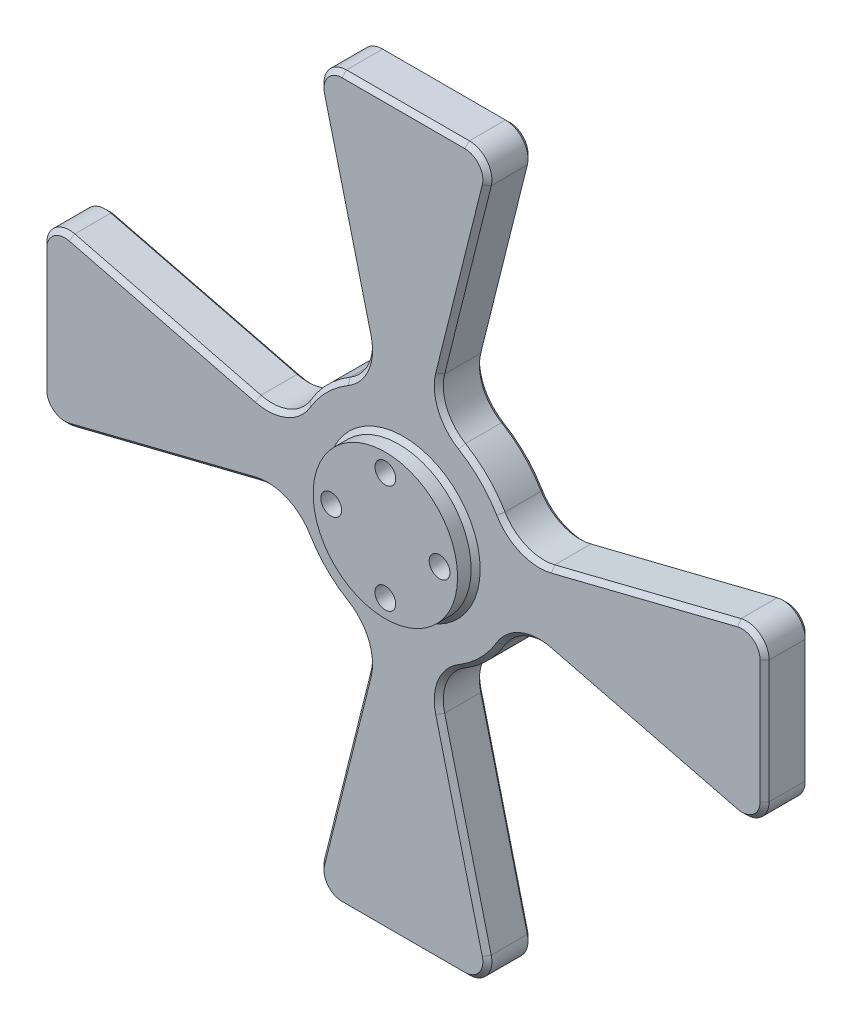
ISO-10303-21;
HEADER;
FILE_DESCRIPTION(('STEP AP214'),'2;1');
FILE_NAME('part.step','',(''),(''),'','','');
FILE_SCHEMA(('AUTOMOTIVE_DESIGN { 1 0 10303 214 1 1 1 1 }'));
ENDSEC;
DATA;
#1=APPLICATION_CONTEXT('core data for automotive mechanical design processes');
#2=APPLICATION_PROTOCOL_DEFINITION('international standard','automotive_design',2000,#1);
#3=PRODUCT_CONTEXT('',#1,'mechanical');
#4=PRODUCT('Part','Part','',(#3));
#5=PRODUCT_RELATED_PRODUCT_CATEGORY('part','',(#4));
#6=PRODUCT_DEFINITION_FORMATION('','',#4);
#7=PRODUCT_DEFINITION_CONTEXT('part definition',#1,'design');
#8=PRODUCT_DEFINITION('design','',#6,#7);
#9=PRODUCT_DEFINITION_SHAPE('','',#8);
#10=(LENGTH_UNIT() NAMED_UNIT(*) SI_UNIT(.MILLI.,.METRE.));
#11=(NAMED_UNIT(*) PLANE_ANGLE_UNIT() SI_UNIT($,.RADIAN.));
#12=(NAMED_UNIT(*) SI_UNIT($,.STERADIAN.) SOLID_ANGLE_UNIT());
#13=UNCERTAINTY_MEASURE_WITH_UNIT(LENGTH_MEASURE(1.E-05),#10,'distance_accuracy_value','');
#14=(GEOMETRIC_REPRESENTATION_CONTEXT(3) GLOBAL_UNCERTAINTY_ASSIGNED_CONTEXT((#13)) GLOBAL_UNIT_ASSIGNED_CONTEXT((#10,
#11,#12)) REPRESENTATION_CONTEXT('',''));
#15=CARTESIAN_POINT('',(0.,0.,0.));
#16=DIRECTION('',(0.,0.,1.));
#17=DIRECTION('',(1.,0.,0.));
#18=AXIS2_PLACEMENT_3D('',#15,#16,#17);
#19=CARTESIAN_POINT('',(0.,0.,5.));
#20=DIRECTION('',(0.,0.,-1.));
#21=DIRECTION('',(-1.,0.,0.));
#22=AXIS2_PLACEMENT_3D('',#19,#20,#21);
#23=CYLINDRICAL_SURFACE('',#22,12.5);
#24=DIRECTION('',(0.,0.,-1.));
#25=VECTOR('',#24,1.);
#26=CARTESIAN_POINT('',(6.37011327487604,10.7550758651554,5.));
#27=LINE('',#26,#25);
#28=CARTESIAN_POINT('',(6.37011327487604,10.7550758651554,0.499999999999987));
#29=VERTEX_POINT('',#28);
#30=CARTESIAN_POINT('',(6.37011327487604,10.7550758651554,4.5));
#31=VERTEX_POINT('',#30);
#32=EDGE_CURVE('E951',#29,#31,#27,.F.);
#33=ORIENTED_EDGE('',*,*,#32,.T.);
#34=CARTESIAN_POINT('',(0.,0.,4.5));
#35=DIRECTION('',(0.,0.,1.));
#36=DIRECTION('',(1.,0.,0.));
#37=AXIS2_PLACEMENT_3D('',#34,#35,#36);
#38=CIRCLE('',#37,12.5);
#39=CARTESIAN_POINT('',(10.7550758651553,6.37011327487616,4.5));
#40=VERTEX_POINT('',#39);
#41=EDGE_CURVE('E640',#31,#40,#38,.F.);
#42=ORIENTED_EDGE('',*,*,#41,.T.);
#43=DIRECTION('',(0.,0.,-1.));
#44=VECTOR('',#43,1.);
#45=CARTESIAN_POINT('',(10.7550758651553,6.37011327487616,5.));
#46=LINE('',#45,#44);
#47=CARTESIAN_POINT('',(10.7550758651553,6.37011327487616,0.499999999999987));
#48=VERTEX_POINT('',#47);
#49=EDGE_CURVE('E947',#40,#48,#46,.T.);
#50=ORIENTED_EDGE('',*,*,#49,.T.);
#51=CARTESIAN_POINT('',(0.,0.,0.499999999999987));
#52=DIRECTION('',(0.,0.,1.));
#53=DIRECTION('',(1.,0.,0.));
#54=AXIS2_PLACEMENT_3D('',#51,#52,#53);
#55=CIRCLE('',#54,12.5);
#56=EDGE_CURVE('E638',#48,#29,#55,.T.);
#57=ORIENTED_EDGE('',*,*,#56,.T.);
#58=EDGE_LOOP('',(#33,#42,#50,#57));
#59=FACE_BOUND('',#58,.T.);
#60=ADVANCED_FACE('F41',(#59),#23,.T.);
#61=DIRECTION('',(0.,0.,-1.));
#62=VECTOR('',#61,1.);
#63=CARTESIAN_POINT('',(10.7550758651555,-6.37011327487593,5.));
#64=LINE('',#63,#62);
#65=CARTESIAN_POINT('',(10.7550758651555,-6.37011327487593,0.499999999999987));
#66=VERTEX_POINT('',#65);
#67=CARTESIAN_POINT('',(10.7550758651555,-6.37011327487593,4.5));
#68=VERTEX_POINT('',#67);
#69=EDGE_CURVE('E969',#66,#68,#64,.F.);
#70=ORIENTED_EDGE('',*,*,#69,.T.);
#71=CARTESIAN_POINT('',(0.,0.,4.5));
#72=DIRECTION('',(0.,0.,1.));
#73=DIRECTION('',(1.,0.,0.));
#74=AXIS2_PLACEMENT_3D('',#71,#72,#73);
#75=CIRCLE('',#74,12.5);
#76=CARTESIAN_POINT('',(6.37011327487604,-10.7550758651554,4.5));
#77=VERTEX_POINT('',#76);
#78=EDGE_CURVE('E672',#68,#77,#75,.F.);
#79=ORIENTED_EDGE('',*,*,#78,.T.);
#80=DIRECTION('',(0.,0.,-1.));
#81=VECTOR('',#80,1.);
#82=CARTESIAN_POINT('',(6.37011327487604,-10.7550758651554,5.));
#83=LINE('',#82,#81);
#84=CARTESIAN_POINT('',(6.37011327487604,-10.7550758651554,0.499999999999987));
#85=VERTEX_POINT('',#84);
#86=EDGE_CURVE('E966',#77,#85,#83,.T.);
#87=ORIENTED_EDGE('',*,*,#86,.T.);
#88=CARTESIAN_POINT('',(0.,0.,0.499999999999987));
#89=DIRECTION('',(0.,0.,1.));
#90=DIRECTION('',(1.,0.,0.));
#91=AXIS2_PLACEMENT_3D('',#88,#89,#90);
#92=CIRCLE('',#91,12.5);
#93=EDGE_CURVE('E670',#85,#66,#92,.T.);
#94=ORIENTED_EDGE('',*,*,#93,.T.);
#95=EDGE_LOOP('',(#70,#79,#87,#94));
#96=FACE_BOUND('',#95,.T.);
#97=ADVANCED_FACE('F1211',(#96),#23,.T.);
#98=DIRECTION('',(0.,0.,-1.));
#99=VECTOR('',#98,1.);
#100=CARTESIAN_POINT('',(-6.37011327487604,-10.7550758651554,5.));
#101=LINE('',#100,#99);
#102=CARTESIAN_POINT('',(-6.37011327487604,-10.7550758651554,0.499999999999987));
#103=VERTEX_POINT('',#102);
#104=CARTESIAN_POINT('',(-6.37011327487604,-10.7550758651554,4.5));
#105=VERTEX_POINT('',#104);
#106=EDGE_CURVE('E979',#103,#105,#101,.F.);
#107=ORIENTED_EDGE('',*,*,#106,.T.);
#108=CARTESIAN_POINT('',(0.,0.,4.5));
#109=DIRECTION('',(0.,0.,1.));
#110=DIRECTION('',(1.,0.,0.));
#111=AXIS2_PLACEMENT_3D('',#108,#109,#110);
#112=CIRCLE('',#111,12.5);
#113=CARTESIAN_POINT('',(-10.7550758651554,-6.37011327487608,4.5));
#114=VERTEX_POINT('',#113);
#115=EDGE_CURVE('E576',#105,#114,#112,.F.);
#116=ORIENTED_EDGE('',*,*,#115,.T.);
#117=DIRECTION('',(0.,0.,-1.));
#118=VECTOR('',#117,1.);
#119=CARTESIAN_POINT('',(-10.7550758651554,-6.37011327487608,5.));
#120=LINE('',#119,#118);
#121=CARTESIAN_POINT('',(-10.7550758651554,-6.37011327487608,0.499999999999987));
#122=VERTEX_POINT('',#121);
#123=EDGE_CURVE('E976',#114,#122,#120,.T.);
#124=ORIENTED_EDGE('',*,*,#123,.T.);
#125=CARTESIAN_POINT('',(0.,0.,0.499999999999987));
#126=DIRECTION('',(0.,0.,1.));
#127=DIRECTION('',(1.,0.,0.));
#128=AXIS2_PLACEMENT_3D('',#125,#126,#127);
#129=CIRCLE('',#128,12.5);
#130=EDGE_CURVE('E574',#122,#103,#129,.T.);
#131=ORIENTED_EDGE('',*,*,#130,.T.);
#132=EDGE_LOOP('',(#107,#116,#124,#131));
#133=FACE_BOUND('',#132,.T.);
#134=ADVANCED_FACE('F1218',(#133),#23,.T.);
#135=DIRECTION('',(0.,0.,-1.));
#136=VECTOR('',#135,1.);
#137=CARTESIAN_POINT('',(-10.7550758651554,6.37011327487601,5.));
#138=LINE('',#137,#136);
#139=CARTESIAN_POINT('',(-10.7550758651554,6.37011327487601,0.499999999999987));
#140=VERTEX_POINT('',#139);
#141=CARTESIAN_POINT('',(-10.7550758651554,6.37011327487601,4.5));
#142=VERTEX_POINT('',#141);
#143=EDGE_CURVE('E954',#140,#142,#138,.F.);
#144=ORIENTED_EDGE('',*,*,#143,.T.);
#145=CARTESIAN_POINT('',(0.,0.,4.5));
#146=DIRECTION('',(0.,0.,1.));
#147=DIRECTION('',(1.,0.,0.));
#148=AXIS2_PLACEMENT_3D('',#145,#146,#147);
#149=CIRCLE('',#148,12.5);
#150=CARTESIAN_POINT('',(-6.37011327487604,10.7550758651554,4.5));
#151=VERTEX_POINT('',#150);
#152=EDGE_CURVE('E608',#142,#151,#149,.F.);
#153=ORIENTED_EDGE('',*,*,#152,.T.);
#154=DIRECTION('',(0.,0.,-1.));
#155=VECTOR('',#154,1.);
#156=CARTESIAN_POINT('',(-6.37011327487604,10.7550758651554,5.));
#157=LINE('',#156,#155);
#158=CARTESIAN_POINT('',(-6.37011327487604,10.7550758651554,0.499999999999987));
#159=VERTEX_POINT('',#158);
#160=EDGE_CURVE('E1068',#151,#159,#157,.T.);
#161=ORIENTED_EDGE('',*,*,#160,.T.);
#162=CARTESIAN_POINT('',(0.,0.,0.499999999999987));
#163=DIRECTION('',(0.,0.,1.));
#164=DIRECTION('',(1.,0.,0.));
#165=AXIS2_PLACEMENT_3D('',#162,#163,#164);
#166=CIRCLE('',#165,12.5);
#167=EDGE_CURVE('E606',#159,#140,#166,.T.);
#168=ORIENTED_EDGE('',*,*,#167,.T.);
#169=EDGE_LOOP('',(#144,#153,#161,#168));
#170=FACE_BOUND('',#169,.T.);
#171=ADVANCED_FACE('F1066',(#170),#23,.T.);
#172=CARTESIAN_POINT('',(0.,0.,5.));
#173=DIRECTION('',(0.,0.,1.));
#174=DIRECTION('',(1.,0.,0.));
#175=AXIS2_PLACEMENT_3D('',#172,#173,#174);
#176=PLANE('',#175);
#177=DIRECTION('',(1.,0.,0.));
#178=VECTOR('',#177,1.);
#179=CARTESIAN_POINT('',(0.,-39.5,5.));
#180=LINE('',#179,#178);
#181=CARTESIAN_POINT('',(-6.79805898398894,-39.5,5.));
#182=VERTEX_POINT('',#181);
#183=CARTESIAN_POINT('',(6.79805898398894,-39.5,5.));
#184=VERTEX_POINT('',#183);
#185=EDGE_CURVE('E554',#182,#184,#180,.T.);
#186=ORIENTED_EDGE('',*,*,#185,.T.);
#187=CARTESIAN_POINT('',(6.79805898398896,-37.5,5.));
#188=DIRECTION('',(0.,0.,1.));
#189=DIRECTION('',(1.,0.,0.));
#190=AXIS2_PLACEMENT_3D('',#187,#188,#189);
#191=CIRCLE('',#190,1.99999999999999);
#192=CARTESIAN_POINT('',(8.73834398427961,-37.0149287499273,5.));
#193=VERTEX_POINT('',#192);
#194=EDGE_CURVE('E556',#184,#193,#191,.T.);
#195=ORIENTED_EDGE('',*,*,#194,.T.);
#196=DIRECTION('',(-0.242535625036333,0.970142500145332,0.));
#197=VECTOR('',#196,1.);
#198=CARTESIAN_POINT('',(-0.485071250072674,-0.121267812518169,5.));
#199=LINE('',#198,#197);
#200=CARTESIAN_POINT('',(3.58237483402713,-16.3910521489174,5.));
#201=VERTEX_POINT('',#200);
#202=EDGE_CURVE('E477',#193,#201,#199,.T.);
#203=ORIENTED_EDGE('',*,*,#202,.T.);
#204=CARTESIAN_POINT('',(8.91815858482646,-15.0571062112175,5.));
#205=DIRECTION('',(0.,0.,1.));
#206=DIRECTION('',(1.,0.,0.));
#207=AXIS2_PLACEMENT_3D('',#204,#205,#206);
#208=CIRCLE('',#207,5.50000000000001);
#209=CARTESIAN_POINT('',(6.115308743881,-10.3248728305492,5.));
#210=VERTEX_POINT('',#209);
#211=EDGE_CURVE('E496',#201,#210,#208,.F.);
#212=ORIENTED_EDGE('',*,*,#211,.T.);
#213=CARTESIAN_POINT('',(0.,0.,5.));
#214=DIRECTION('',(0.,0.,1.));
#215=DIRECTION('',(1.,0.,0.));
#216=AXIS2_PLACEMENT_3D('',#213,#214,#215);
#217=CIRCLE('',#216,12.);
#218=CARTESIAN_POINT('',(10.3248728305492,-6.11530874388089,5.));
#219=VERTEX_POINT('',#218);
#220=EDGE_CURVE('E498',#210,#219,#217,.T.);
#221=ORIENTED_EDGE('',*,*,#220,.T.);
#222=CARTESIAN_POINT('',(15.0571062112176,-8.9181585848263,5.));
#223=DIRECTION('',(0.,0.,1.));
#224=DIRECTION('',(1.,0.,0.));
#225=AXIS2_PLACEMENT_3D('',#222,#223,#224);
#226=CIRCLE('',#225,5.50000000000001);
#227=CARTESIAN_POINT('',(16.3910521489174,-3.58237483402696,5.));
#228=VERTEX_POINT('',#227);
#229=EDGE_CURVE('E500',#219,#228,#226,.F.);
#230=ORIENTED_EDGE('',*,*,#229,.T.);
#231=DIRECTION('',(0.970142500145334,-0.242535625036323,0.));
#232=VECTOR('',#231,1.);
#233=CARTESIAN_POINT('',(0.121267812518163,0.485071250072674,5.));
#234=LINE('',#233,#232);
#235=CARTESIAN_POINT('',(37.0149287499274,-8.73834398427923,5.));
#236=VERTEX_POINT('',#235);
#237=EDGE_CURVE('E502',#228,#236,#234,.T.);
#238=ORIENTED_EDGE('',*,*,#237,.T.);
#239=CARTESIAN_POINT('',(37.5000000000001,-6.79805898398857,5.));
#240=DIRECTION('',(0.,0.,1.));
#241=DIRECTION('',(1.,0.,0.));
#242=AXIS2_PLACEMENT_3D('',#239,#240,#241);
#243=CIRCLE('',#242,1.99999999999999);
#244=CARTESIAN_POINT('',(39.5000000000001,-6.79805898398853,5.));
#245=VERTEX_POINT('',#244);
#246=EDGE_CURVE('E504',#236,#245,#243,.T.);
#247=ORIENTED_EDGE('',*,*,#246,.T.);
#248=DIRECTION('',(0.,1.,0.));
#249=VECTOR('',#248,1.);
#250=CARTESIAN_POINT('',(39.5,4.13740538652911E-13,5.));
#251=LINE('',#250,#249);
#252=CARTESIAN_POINT('',(39.4999999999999,6.79805898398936,5.));
#253=VERTEX_POINT('',#252);
#254=EDGE_CURVE('E506',#245,#253,#251,.T.);
#255=ORIENTED_EDGE('',*,*,#254,.T.);
#256=CARTESIAN_POINT('',(37.4999999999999,6.79805898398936,5.));
#257=DIRECTION('',(0.,0.,1.));
#258=DIRECTION('',(1.,0.,0.));
#259=AXIS2_PLACEMENT_3D('',#256,#257,#258);
#260=CIRCLE('',#259,1.99999999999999);
#261=CARTESIAN_POINT('',(37.0149287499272,8.73834398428,5.));
#262=VERTEX_POINT('',#261);
#263=EDGE_CURVE('E508',#253,#262,#260,.T.);
#264=ORIENTED_EDGE('',*,*,#263,.T.);
#265=DIRECTION('',(-0.97014250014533,-0.242535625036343,0.));
#266=VECTOR('',#265,1.);
#267=CARTESIAN_POINT('',(0.121267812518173,-0.485071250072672,5.));
#268=LINE('',#267,#266);
#269=CARTESIAN_POINT('',(16.3910521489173,3.5823748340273,5.));
#270=VERTEX_POINT('',#269);
#271=EDGE_CURVE('E510',#262,#270,#268,.T.);
#272=ORIENTED_EDGE('',*,*,#271,.T.);
#273=CARTESIAN_POINT('',(15.0571062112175,8.91815858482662,5.));
#274=DIRECTION('',(0.,0.,1.));
#275=DIRECTION('',(1.,0.,0.));
#276=AXIS2_PLACEMENT_3D('',#273,#274,#275);
#277=CIRCLE('',#276,5.50000000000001);
#278=CARTESIAN_POINT('',(10.3248728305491,6.11530874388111,5.));
#279=VERTEX_POINT('',#278);
#280=EDGE_CURVE('E512',#270,#279,#277,.F.);
#281=ORIENTED_EDGE('',*,*,#280,.T.);
#282=CARTESIAN_POINT('',(0.,0.,5.));
#283=DIRECTION('',(0.,0.,1.));
#284=DIRECTION('',(1.,0.,0.));
#285=AXIS2_PLACEMENT_3D('',#282,#283,#284);
#286=CIRCLE('',#285,12.);
#287=CARTESIAN_POINT('',(6.11530874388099,10.3248728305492,5.));
#288=VERTEX_POINT('',#287);
#289=EDGE_CURVE('E514',#279,#288,#286,.T.);
#290=ORIENTED_EDGE('',*,*,#289,.T.);
#291=CARTESIAN_POINT('',(8.91815858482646,15.0571062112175,5.));
#292=DIRECTION('',(0.,0.,1.));
#293=DIRECTION('',(1.,0.,0.));
#294=AXIS2_PLACEMENT_3D('',#291,#292,#293);
#295=CIRCLE('',#294,5.50000000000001);
#296=CARTESIAN_POINT('',(3.58237483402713,16.3910521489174,5.));
#297=VERTEX_POINT('',#296);
#298=EDGE_CURVE('E516',#288,#297,#295,.F.);
#299=ORIENTED_EDGE('',*,*,#298,.T.);
#300=DIRECTION('',(0.242535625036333,0.970142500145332,0.));
#301=VECTOR('',#300,1.);
#302=CARTESIAN_POINT('',(-0.485071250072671,0.121267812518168,5.));
#303=LINE('',#302,#301);
#304=CARTESIAN_POINT('',(8.73834398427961,37.0149287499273,5.));
#305=VERTEX_POINT('',#304);
#306=EDGE_CURVE('E518',#297,#305,#303,.T.);
#307=ORIENTED_EDGE('',*,*,#306,.T.);
#308=CARTESIAN_POINT('',(6.79805898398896,37.5,5.));
#309=DIRECTION('',(0.,0.,1.));
#310=DIRECTION('',(1.,0.,0.));
#311=AXIS2_PLACEMENT_3D('',#308,#309,#310);
#312=CIRCLE('',#311,1.99999999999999);
#313=CARTESIAN_POINT('',(6.79805898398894,39.5,5.));
#314=VERTEX_POINT('',#313);
#315=EDGE_CURVE('E520',#305,#314,#312,.T.);
#316=ORIENTED_EDGE('',*,*,#315,.T.);
#317=DIRECTION('',(-1.,0.,0.));
#318=VECTOR('',#317,1.);
#319=CARTESIAN_POINT('',(0.,39.5,5.));
#320=LINE('',#319,#318);
#321=CARTESIAN_POINT('',(-6.79805898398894,39.5,5.));
#322=VERTEX_POINT('',#321);
#323=EDGE_CURVE('E522',#314,#322,#320,.T.);
#324=ORIENTED_EDGE('',*,*,#323,.T.);
#325=CARTESIAN_POINT('',(-6.79805898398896,37.5,5.));
#326=DIRECTION('',(0.,0.,1.));
#327=DIRECTION('',(1.,0.,0.));
#328=AXIS2_PLACEMENT_3D('',#325,#326,#327);
#329=CIRCLE('',#328,1.99999999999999);
#330=CARTESIAN_POINT('',(-8.73834398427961,37.0149287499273,5.));
#331=VERTEX_POINT('',#330);
#332=EDGE_CURVE('E524',#322,#331,#329,.T.);
#333=ORIENTED_EDGE('',*,*,#332,.T.);
#334=DIRECTION('',(0.242535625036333,-0.970142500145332,0.));
#335=VECTOR('',#334,1.);
#336=CARTESIAN_POINT('',(0.485071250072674,0.121267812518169,5.));
#337=LINE('',#336,#335);
#338=CARTESIAN_POINT('',(-3.58237483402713,16.3910521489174,5.));
#339=VERTEX_POINT('',#338);
#340=EDGE_CURVE('E526',#331,#339,#337,.T.);
#341=ORIENTED_EDGE('',*,*,#340,.T.);
#342=CARTESIAN_POINT('',(-8.91815858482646,15.0571062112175,5.));
#343=DIRECTION('',(0.,0.,1.));
#344=DIRECTION('',(1.,0.,0.));
#345=AXIS2_PLACEMENT_3D('',#342,#343,#344);
#346=CIRCLE('',#345,5.50000000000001);
#347=CARTESIAN_POINT('',(-6.115308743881,10.3248728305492,5.));
#348=VERTEX_POINT('',#347);
#349=EDGE_CURVE('E528',#339,#348,#346,.F.);
#350=ORIENTED_EDGE('',*,*,#349,.T.);
#351=CARTESIAN_POINT('',(0.,0.,5.));
#352=DIRECTION('',(0.,0.,1.));
#353=DIRECTION('',(1.,0.,0.));
#354=AXIS2_PLACEMENT_3D('',#351,#352,#353);
#355=CIRCLE('',#354,12.);
#356=CARTESIAN_POINT('',(-10.3248728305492,6.11530874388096,5.));
#357=VERTEX_POINT('',#356);
#358=EDGE_CURVE('E530',#348,#357,#355,.T.);
#359=ORIENTED_EDGE('',*,*,#358,.T.);
#360=CARTESIAN_POINT('',(-15.0571062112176,8.91815858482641,5.));
#361=DIRECTION('',(0.,0.,1.));
#362=DIRECTION('',(1.,0.,0.));
#363=AXIS2_PLACEMENT_3D('',#360,#361,#362);
#364=CIRCLE('',#363,5.50000000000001);
#365=CARTESIAN_POINT('',(-16.3910521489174,3.58237483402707,5.));
#366=VERTEX_POINT('',#365);
#367=EDGE_CURVE('E532',#357,#366,#364,.F.);
#368=ORIENTED_EDGE('',*,*,#367,.T.);
#369=DIRECTION('',(-0.970142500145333,0.24253562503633,0.));
#370=VECTOR('',#369,1.);
#371=CARTESIAN_POINT('',(-0.121267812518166,-0.485071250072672,5.));
#372=LINE('',#371,#370);
#373=CARTESIAN_POINT('',(-37.0149287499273,8.73834398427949,5.));
#374=VERTEX_POINT('',#373);
#375=EDGE_CURVE('E534',#366,#374,#372,.T.);
#376=ORIENTED_EDGE('',*,*,#375,.T.);
#377=CARTESIAN_POINT('',(-37.5,6.79805898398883,5.));
#378=DIRECTION('',(0.,0.,1.));
#379=DIRECTION('',(1.,0.,0.));
#380=AXIS2_PLACEMENT_3D('',#377,#378,#379);
#381=CIRCLE('',#380,1.99999999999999);
#382=CARTESIAN_POINT('',(-39.5,6.7980589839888,5.));
#383=VERTEX_POINT('',#382);
#384=EDGE_CURVE('E536',#374,#383,#381,.T.);
#385=ORIENTED_EDGE('',*,*,#384,.T.);
#386=DIRECTION('',(0.,-1.,0.));
#387=VECTOR('',#386,1.);
#388=CARTESIAN_POINT('',(-39.5,-1.37913512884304E-13,5.));
#389=LINE('',#388,#387);
#390=CARTESIAN_POINT('',(-39.5,-6.79805898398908,5.));
#391=VERTEX_POINT('',#390);
#392=EDGE_CURVE('E538',#383,#391,#389,.T.);
#393=ORIENTED_EDGE('',*,*,#392,.T.);
#394=CARTESIAN_POINT('',(-37.5,-6.79805898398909,5.));
#395=DIRECTION('',(0.,0.,1.));
#396=DIRECTION('',(1.,0.,0.));
#397=AXIS2_PLACEMENT_3D('',#394,#395,#396);
#398=CIRCLE('',#397,1.99999999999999);
#399=CARTESIAN_POINT('',(-37.0149287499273,-8.73834398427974,5.));
#400=VERTEX_POINT('',#399);
#401=EDGE_CURVE('E540',#391,#400,#398,.T.);
#402=ORIENTED_EDGE('',*,*,#401,.T.);
#403=DIRECTION('',(0.970142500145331,0.242535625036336,0.));
#404=VECTOR('',#403,1.);
#405=CARTESIAN_POINT('',(-0.12126781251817,0.485071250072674,5.));
#406=LINE('',#405,#404);
#407=CARTESIAN_POINT('',(-16.3910521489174,-3.58237483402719,5.));
#408=VERTEX_POINT('',#407);
#409=EDGE_CURVE('E542',#400,#408,#406,.T.);
#410=ORIENTED_EDGE('',*,*,#409,.T.);
#411=CARTESIAN_POINT('',(-15.0571062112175,-8.91815858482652,5.));
#412=DIRECTION('',(0.,0.,1.));
#413=DIRECTION('',(1.,0.,0.));
#414=AXIS2_PLACEMENT_3D('',#411,#412,#413);
#415=CIRCLE('',#414,5.50000000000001);
#416=CARTESIAN_POINT('',(-10.3248728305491,-6.11530874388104,5.));
#417=VERTEX_POINT('',#416);
#418=EDGE_CURVE('E544',#408,#417,#415,.F.);
#419=ORIENTED_EDGE('',*,*,#418,.T.);
#420=CARTESIAN_POINT('',(0.,0.,5.));
#421=DIRECTION('',(0.,0.,1.));
#422=DIRECTION('',(1.,0.,0.));
#423=AXIS2_PLACEMENT_3D('',#420,#421,#422);
#424=CIRCLE('',#423,12.);
#425=CARTESIAN_POINT('',(-6.11530874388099,-10.3248728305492,5.));
#426=VERTEX_POINT('',#425);
#427=EDGE_CURVE('E546',#417,#426,#424,.T.);
#428=ORIENTED_EDGE('',*,*,#427,.T.);
#429=CARTESIAN_POINT('',(-8.91815858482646,-15.0571062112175,5.));
#430=DIRECTION('',(0.,0.,1.));
#431=DIRECTION('',(1.,0.,0.));
#432=AXIS2_PLACEMENT_3D('',#429,#430,#431);
#433=CIRCLE('',#432,5.50000000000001);
#434=CARTESIAN_POINT('',(-3.58237483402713,-16.3910521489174,5.));
#435=VERTEX_POINT('',#434);
#436=EDGE_CURVE('E548',#426,#435,#433,.F.);
#437=ORIENTED_EDGE('',*,*,#436,.T.);
#438=DIRECTION('',(-0.242535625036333,-0.970142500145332,0.));
#439=VECTOR('',#438,1.);
#440=CARTESIAN_POINT('',(0.485071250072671,-0.121267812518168,5.));
#441=LINE('',#440,#439);
#442=CARTESIAN_POINT('',(-8.73834398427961,-37.0149287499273,5.));
#443=VERTEX_POINT('',#442);
#444=EDGE_CURVE('E550',#435,#443,#441,.T.);
#445=ORIENTED_EDGE('',*,*,#444,.T.);
#446=CARTESIAN_POINT('',(-6.79805898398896,-37.5,5.));
#447=DIRECTION('',(0.,0.,1.));
#448=DIRECTION('',(1.,0.,0.));
#449=AXIS2_PLACEMENT_3D('',#446,#447,#448);
#450=CIRCLE('',#449,1.99999999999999);
#451=EDGE_CURVE('E552',#443,#182,#450,.T.);
#452=ORIENTED_EDGE('',*,*,#451,.T.);
#453=EDGE_LOOP('',(#186,#195,#203,#212,#221,#230,#238,#247,#255,#264,#272,#281,#290,#299,#307,
#316,#324,#333,#341,#350,#359,#368,#376,#385,#393,#402,#410,#419,#428,#437,#445,#452));
#454=FACE_BOUND('',#453,.T.);
#455=CARTESIAN_POINT('',(0.,0.,5.));
#456=DIRECTION('',(0.,0.,1.));
#457=DIRECTION('',(1.,0.,0.));
#458=AXIS2_PLACEMENT_3D('',#455,#456,#457);
#459=CIRCLE('',#458,8.50000000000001);
#460=CARTESIAN_POINT('',(8.50000000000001,0.,5.));
#461=VERTEX_POINT('',#460);
#462=EDGE_CURVE('E487',#461,#461,#459,.F.);
#463=ORIENTED_EDGE('',*,*,#462,.T.);
#464=EDGE_LOOP('',(#463));
#465=FACE_BOUND('',#464,.T.);
#466=ADVANCED_FACE('F1006',(#454,#465),#176,.T.);
#467=CARTESIAN_POINT('',(0.,0.,0.));
#468=DIRECTION('',(0.,0.,1.));
#469=DIRECTION('',(1.,0.,0.));
#470=AXIS2_PLACEMENT_3D('',#467,#468,#469);
#471=PLANE('',#470);
#472=CARTESIAN_POINT('',(8.91815858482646,-15.0571062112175,0.));
#473=DIRECTION('',(0.,0.,1.));
#474=DIRECTION('',(1.,0.,0.));
#475=AXIS2_PLACEMENT_3D('',#472,#473,#474);
#476=CIRCLE('',#475,5.49999999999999);
#477=CARTESIAN_POINT('',(6.115308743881,-10.3248728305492,0.));
#478=VERTEX_POINT('',#477);
#479=CARTESIAN_POINT('',(3.58237483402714,-16.3910521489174,0.));
#480=VERTEX_POINT('',#479);
#481=EDGE_CURVE('E66',#478,#480,#476,.T.);
#482=ORIENTED_EDGE('',*,*,#481,.T.);
#483=DIRECTION('',(0.242535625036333,-0.970142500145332,0.));
#484=VECTOR('',#483,1.);
#485=CARTESIAN_POINT('',(8.73834398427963,-37.0149287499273,0.));
#486=LINE('',#485,#484);
#487=CARTESIAN_POINT('',(8.73834398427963,-37.0149287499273,0.));
#488=VERTEX_POINT('',#487);
#489=EDGE_CURVE('E11',#480,#488,#486,.T.);
#490=ORIENTED_EDGE('',*,*,#489,.T.);
#491=CARTESIAN_POINT('',(6.79805898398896,-37.5,0.));
#492=DIRECTION('',(0.,0.,1.));
#493=DIRECTION('',(1.,0.,0.));
#494=AXIS2_PLACEMENT_3D('',#491,#492,#493);
#495=CIRCLE('',#494,2.00000000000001);
#496=CARTESIAN_POINT('',(6.79805898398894,-39.5,0.));
#497=VERTEX_POINT('',#496);
#498=EDGE_CURVE('E51',#488,#497,#495,.F.);
#499=ORIENTED_EDGE('',*,*,#498,.T.);
#500=DIRECTION('',(-1.,0.,0.));
#501=VECTOR('',#500,1.);
#502=CARTESIAN_POINT('',(-6.79805898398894,-39.5,0.));
#503=LINE('',#502,#501);
#504=CARTESIAN_POINT('',(-6.79805898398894,-39.5,0.));
#505=VERTEX_POINT('',#504);
#506=EDGE_CURVE('E737',#497,#505,#503,.T.);
#507=ORIENTED_EDGE('',*,*,#506,.T.);
#508=CARTESIAN_POINT('',(-6.79805898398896,-37.5,0.));
#509=DIRECTION('',(0.,0.,1.));
#510=DIRECTION('',(1.,0.,0.));
#511=AXIS2_PLACEMENT_3D('',#508,#509,#510);
#512=CIRCLE('',#511,2.00000000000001);
#513=CARTESIAN_POINT('',(-8.73834398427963,-37.0149287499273,0.));
#514=VERTEX_POINT('',#513);
#515=EDGE_CURVE('E733',#505,#514,#512,.F.);
#516=ORIENTED_EDGE('',*,*,#515,.T.);
#517=DIRECTION('',(0.242535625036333,0.970142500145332,0.));
#518=VECTOR('',#517,1.);
#519=CARTESIAN_POINT('',(-3.58237483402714,-16.3910521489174,0.));
#520=LINE('',#519,#518);
#521=CARTESIAN_POINT('',(-3.58237483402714,-16.3910521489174,0.));
#522=VERTEX_POINT('',#521);
#523=EDGE_CURVE('E729',#514,#522,#520,.T.);
#524=ORIENTED_EDGE('',*,*,#523,.T.);
#525=CARTESIAN_POINT('',(-8.91815858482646,-15.0571062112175,0.));
#526=DIRECTION('',(0.,0.,1.));
#527=DIRECTION('',(1.,0.,0.));
#528=AXIS2_PLACEMENT_3D('',#525,#526,#527);
#529=CIRCLE('',#528,5.49999999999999);
#530=CARTESIAN_POINT('',(-6.115308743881,-10.3248728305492,0.));
#531=VERTEX_POINT('',#530);
#532=EDGE_CURVE('E725',#522,#531,#529,.T.);
#533=ORIENTED_EDGE('',*,*,#532,.T.);
#534=CARTESIAN_POINT('',(0.,0.,0.));
#535=DIRECTION('',(0.,0.,1.));
#536=DIRECTION('',(1.,0.,0.));
#537=AXIS2_PLACEMENT_3D('',#534,#535,#536);
#538=CIRCLE('',#537,12.);
#539=CARTESIAN_POINT('',(-10.3248728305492,-6.11530874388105,0.));
#540=VERTEX_POINT('',#539);
#541=EDGE_CURVE('E721',#531,#540,#538,.F.);
#542=ORIENTED_EDGE('',*,*,#541,.T.);
#543=CARTESIAN_POINT('',(-15.0571062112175,-8.91815858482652,0.));
#544=DIRECTION('',(0.,0.,1.));
#545=DIRECTION('',(1.,0.,0.));
#546=AXIS2_PLACEMENT_3D('',#543,#544,#545);
#547=CIRCLE('',#546,5.49999999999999);
#548=CARTESIAN_POINT('',(-16.3910521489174,-3.5823748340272,0.));
#549=VERTEX_POINT('',#548);
#550=EDGE_CURVE('E717',#540,#549,#547,.T.);
#551=ORIENTED_EDGE('',*,*,#550,.T.);
#552=DIRECTION('',(-0.970142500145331,-0.242535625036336,0.));
#553=VECTOR('',#552,1.);
#554=CARTESIAN_POINT('',(-37.0149287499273,-8.73834398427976,0.));
#555=LINE('',#554,#553);
#556=CARTESIAN_POINT('',(-37.0149287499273,-8.73834398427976,0.));
#557=VERTEX_POINT('',#556);
#558=EDGE_CURVE('E713',#549,#557,#555,.T.);
#559=ORIENTED_EDGE('',*,*,#558,.T.);
#560=CARTESIAN_POINT('',(-37.5,-6.79805898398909,0.));
#561=DIRECTION('',(0.,0.,1.));
#562=DIRECTION('',(1.,0.,0.));
#563=AXIS2_PLACEMENT_3D('',#560,#561,#562);
#564=CIRCLE('',#563,2.00000000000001);
#565=CARTESIAN_POINT('',(-39.5,-6.79805898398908,0.));
#566=VERTEX_POINT('',#565);
#567=EDGE_CURVE('E709',#557,#566,#564,.F.);
#568=ORIENTED_EDGE('',*,*,#567,.T.);
#569=DIRECTION('',(0.,1.,0.));
#570=VECTOR('',#569,1.);
#571=CARTESIAN_POINT('',(-39.5,6.7980589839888,0.));
#572=LINE('',#571,#570);
#573=CARTESIAN_POINT('',(-39.5,6.7980589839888,0.));
#574=VERTEX_POINT('',#573);
#575=EDGE_CURVE('E705',#566,#574,#572,.T.);
#576=ORIENTED_EDGE('',*,*,#575,.T.);
#577=CARTESIAN_POINT('',(-37.5,6.79805898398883,0.));
#578=DIRECTION('',(0.,0.,1.));
#579=DIRECTION('',(1.,0.,0.));
#580=AXIS2_PLACEMENT_3D('',#577,#578,#579);
#581=CIRCLE('',#580,2.00000000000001);
#582=CARTESIAN_POINT('',(-37.0149287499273,8.7383439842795,0.));
#583=VERTEX_POINT('',#582);
#584=EDGE_CURVE('E701',#574,#583,#581,.F.);
#585=ORIENTED_EDGE('',*,*,#584,.T.);
#586=DIRECTION('',(0.970142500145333,-0.24253562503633,0.));
#587=VECTOR('',#586,1.);
#588=CARTESIAN_POINT('',(-16.3910521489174,3.58237483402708,0.));
#589=LINE('',#588,#587);
#590=CARTESIAN_POINT('',(-16.3910521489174,3.58237483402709,0.));
#591=VERTEX_POINT('',#590);
#592=EDGE_CURVE('E697',#583,#591,#589,.T.);
#593=ORIENTED_EDGE('',*,*,#592,.T.);
#594=CARTESIAN_POINT('',(-15.0571062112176,8.91815858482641,0.));
#595=DIRECTION('',(0.,0.,1.));
#596=DIRECTION('',(1.,0.,0.));
#597=AXIS2_PLACEMENT_3D('',#594,#595,#596);
#598=CIRCLE('',#597,5.5);
#599=CARTESIAN_POINT('',(-10.3248728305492,6.11530874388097,0.));
#600=VERTEX_POINT('',#599);
#601=EDGE_CURVE('E693',#591,#600,#598,.T.);
#602=ORIENTED_EDGE('',*,*,#601,.T.);
#603=CARTESIAN_POINT('',(0.,0.,0.));
#604=DIRECTION('',(0.,0.,1.));
#605=DIRECTION('',(1.,0.,0.));
#606=AXIS2_PLACEMENT_3D('',#603,#604,#605);
#607=CIRCLE('',#606,12.);
#608=CARTESIAN_POINT('',(-6.115308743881,10.3248728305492,0.));
#609=VERTEX_POINT('',#608);
#610=EDGE_CURVE('E689',#600,#609,#607,.F.);
#611=ORIENTED_EDGE('',*,*,#610,.T.);
#612=CARTESIAN_POINT('',(-8.91815858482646,15.0571062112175,0.));
#613=DIRECTION('',(0.,0.,1.));
#614=DIRECTION('',(1.,0.,0.));
#615=AXIS2_PLACEMENT_3D('',#612,#613,#614);
#616=CIRCLE('',#615,5.49999999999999);
#617=CARTESIAN_POINT('',(-3.58237483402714,16.3910521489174,0.));
#618=VERTEX_POINT('',#617);
#619=EDGE_CURVE('E685',#609,#618,#616,.T.);
#620=ORIENTED_EDGE('',*,*,#619,.T.);
#621=DIRECTION('',(-0.242535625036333,0.970142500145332,0.));
#622=VECTOR('',#621,1.);
#623=CARTESIAN_POINT('',(-8.73834398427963,37.0149287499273,0.));
#624=LINE('',#623,#622);
#625=CARTESIAN_POINT('',(-8.73834398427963,37.0149287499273,0.));
#626=VERTEX_POINT('',#625);
#627=EDGE_CURVE('E681',#618,#626,#624,.T.);
#628=ORIENTED_EDGE('',*,*,#627,.T.);
#629=CARTESIAN_POINT('',(-6.79805898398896,37.5,0.));
#630=DIRECTION('',(0.,0.,1.));
#631=DIRECTION('',(1.,0.,0.));
#632=AXIS2_PLACEMENT_3D('',#629,#630,#631);
#633=CIRCLE('',#632,2.00000000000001);
#634=CARTESIAN_POINT('',(-6.79805898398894,39.5,0.));
#635=VERTEX_POINT('',#634);
#636=EDGE_CURVE('E683',#626,#635,#633,.F.);
#637=ORIENTED_EDGE('',*,*,#636,.T.);
#638=DIRECTION('',(1.,0.,0.));
#639=VECTOR('',#638,1.);
#640=CARTESIAN_POINT('',(6.79805898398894,39.5,0.));
#641=LINE('',#640,#639);
#642=CARTESIAN_POINT('',(6.79805898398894,39.5,0.));
#643=VERTEX_POINT('',#642);
#644=EDGE_CURVE('E687',#635,#643,#641,.T.);
#645=ORIENTED_EDGE('',*,*,#644,.T.);
#646=CARTESIAN_POINT('',(6.79805898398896,37.5,0.));
#647=DIRECTION('',(0.,0.,1.));
#648=DIRECTION('',(1.,0.,0.));
#649=AXIS2_PLACEMENT_3D('',#646,#647,#648);
#650=CIRCLE('',#649,2.00000000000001);
#651=CARTESIAN_POINT('',(8.73834398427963,37.0149287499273,0.));
#652=VERTEX_POINT('',#651);
#653=EDGE_CURVE('E691',#643,#652,#650,.F.);
#654=ORIENTED_EDGE('',*,*,#653,.T.);
#655=DIRECTION('',(-0.242535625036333,-0.970142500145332,0.));
#656=VECTOR('',#655,1.);
#657=CARTESIAN_POINT('',(3.58237483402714,16.3910521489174,0.));
#658=LINE('',#657,#656);
#659=CARTESIAN_POINT('',(3.58237483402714,16.3910521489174,0.));
#660=VERTEX_POINT('',#659);
#661=EDGE_CURVE('E695',#652,#660,#658,.T.);
#662=ORIENTED_EDGE('',*,*,#661,.T.);
#663=CARTESIAN_POINT('',(8.91815858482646,15.0571062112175,0.));
#664=DIRECTION('',(0.,0.,1.));
#665=DIRECTION('',(1.,0.,0.));
#666=AXIS2_PLACEMENT_3D('',#663,#664,#665);
#667=CIRCLE('',#666,5.49999999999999);
#668=CARTESIAN_POINT('',(6.115308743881,10.3248728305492,0.));
#669=VERTEX_POINT('',#668);
#670=EDGE_CURVE('E699',#660,#669,#667,.T.);
#671=ORIENTED_EDGE('',*,*,#670,.T.);
#672=CARTESIAN_POINT('',(0.,0.,0.));
#673=DIRECTION('',(0.,0.,1.));
#674=DIRECTION('',(1.,0.,0.));
#675=AXIS2_PLACEMENT_3D('',#672,#673,#674);
#676=CIRCLE('',#675,12.);
#677=CARTESIAN_POINT('',(10.3248728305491,6.11530874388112,0.));
#678=VERTEX_POINT('',#677);
#679=EDGE_CURVE('E703',#669,#678,#676,.F.);
#680=ORIENTED_EDGE('',*,*,#679,.T.);
#681=CARTESIAN_POINT('',(15.0571062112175,8.91815858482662,0.));
#682=DIRECTION('',(0.,0.,1.));
#683=DIRECTION('',(1.,0.,0.));
#684=AXIS2_PLACEMENT_3D('',#681,#682,#683);
#685=CIRCLE('',#684,5.49999999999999);
#686=CARTESIAN_POINT('',(16.3910521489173,3.58237483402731,0.));
#687=VERTEX_POINT('',#686);
#688=EDGE_CURVE('E707',#678,#687,#685,.T.);
#689=ORIENTED_EDGE('',*,*,#688,.T.);
#690=DIRECTION('',(0.97014250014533,0.242535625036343,0.));
#691=VECTOR('',#690,1.);
#692=CARTESIAN_POINT('',(37.0149287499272,8.73834398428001,0.));
#693=LINE('',#692,#691);
#694=CARTESIAN_POINT('',(37.0149287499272,8.73834398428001,0.));
#695=VERTEX_POINT('',#694);
#696=EDGE_CURVE('E711',#687,#695,#693,.T.);
#697=ORIENTED_EDGE('',*,*,#696,.T.);
#698=CARTESIAN_POINT('',(37.4999999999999,6.79805898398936,0.));
#699=DIRECTION('',(0.,0.,1.));
#700=DIRECTION('',(1.,0.,0.));
#701=AXIS2_PLACEMENT_3D('',#698,#699,#700);
#702=CIRCLE('',#701,2.00000000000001);
#703=CARTESIAN_POINT('',(39.4999999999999,6.79805898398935,0.));
#704=VERTEX_POINT('',#703);
#705=EDGE_CURVE('E715',#695,#704,#702,.F.);
#706=ORIENTED_EDGE('',*,*,#705,.T.);
#707=DIRECTION('',(0.,-1.,0.));
#708=VECTOR('',#707,1.);
#709=CARTESIAN_POINT('',(39.5000000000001,-6.79805898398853,0.));
#710=LINE('',#709,#708);
#711=CARTESIAN_POINT('',(39.5000000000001,-6.79805898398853,0.));
#712=VERTEX_POINT('',#711);
#713=EDGE_CURVE('E719',#704,#712,#710,.T.);
#714=ORIENTED_EDGE('',*,*,#713,.T.);
#715=CARTESIAN_POINT('',(37.5000000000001,-6.79805898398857,0.));
#716=DIRECTION('',(0.,0.,1.));
#717=DIRECTION('',(1.,0.,0.));
#718=AXIS2_PLACEMENT_3D('',#715,#716,#717);
#719=CIRCLE('',#718,2.00000000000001);
#720=CARTESIAN_POINT('',(37.0149287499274,-8.73834398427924,0.));
#721=VERTEX_POINT('',#720);
#722=EDGE_CURVE('E723',#712,#721,#719,.F.);
#723=ORIENTED_EDGE('',*,*,#722,.T.);
#724=DIRECTION('',(-0.970142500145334,0.242535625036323,0.));
#725=VECTOR('',#724,1.);
#726=CARTESIAN_POINT('',(16.3910521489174,-3.58237483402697,0.));
#727=LINE('',#726,#725);
#728=CARTESIAN_POINT('',(16.3910521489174,-3.58237483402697,0.));
#729=VERTEX_POINT('',#728);
#730=EDGE_CURVE('E727',#721,#729,#727,.T.);
#731=ORIENTED_EDGE('',*,*,#730,.T.);
#732=CARTESIAN_POINT('',(15.0571062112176,-8.9181585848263,0.));
#733=DIRECTION('',(0.,0.,1.));
#734=DIRECTION('',(1.,0.,0.));
#735=AXIS2_PLACEMENT_3D('',#732,#733,#734);
#736=CIRCLE('',#735,5.49999999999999);
#737=CARTESIAN_POINT('',(10.3248728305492,-6.1153087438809,0.));
#738=VERTEX_POINT('',#737);
#739=EDGE_CURVE('E731',#729,#738,#736,.T.);
#740=ORIENTED_EDGE('',*,*,#739,.T.);
#741=CARTESIAN_POINT('',(0.,0.,0.));
#742=DIRECTION('',(0.,0.,1.));
#743=DIRECTION('',(1.,0.,0.));
#744=AXIS2_PLACEMENT_3D('',#741,#742,#743);
#745=CIRCLE('',#744,12.);
#746=EDGE_CURVE('E735',#738,#478,#745,.F.);
#747=ORIENTED_EDGE('',*,*,#746,.T.);
#748=EDGE_LOOP('',(#482,#490,#499,#507,#516,#524,#533,#542,#551,#559,#568,#576,#585,#593,#602,
#611,#620,#628,#637,#645,#654,#662,#671,#680,#689,#697,#706,#714,#723,#731,#740,#747));
#749=FACE_BOUND('',#748,.T.);
#750=CARTESIAN_POINT('',(0.,6.,0.));
#751=DIRECTION('',(0.,0.,1.));
#752=DIRECTION('',(1.,0.,0.));
#753=AXIS2_PLACEMENT_3D('',#750,#751,#752);
#754=CIRCLE('',#753,1.15);
#755=CARTESIAN_POINT('',(1.15,6.,0.));
#756=VERTEX_POINT('',#755);
#757=EDGE_CURVE('E1153',#756,#756,#754,.T.);
#758=ORIENTED_EDGE('',*,*,#757,.T.);
#759=EDGE_LOOP('',(#758));
#760=FACE_BOUND('',#759,.T.);
#761=CARTESIAN_POINT('',(6.,0.,0.));
#762=DIRECTION('',(0.,0.,1.));
#763=DIRECTION('',(1.,0.,0.));
#764=AXIS2_PLACEMENT_3D('',#761,#762,#763);
#765=CIRCLE('',#764,1.15);
#766=CARTESIAN_POINT('',(7.15,0.,0.));
#767=VERTEX_POINT('',#766);
#768=EDGE_CURVE('E1163',#767,#767,#765,.T.);
#769=ORIENTED_EDGE('',*,*,#768,.T.);
#770=EDGE_LOOP('',(#769));
#771=FACE_BOUND('',#770,.T.);
#772=CARTESIAN_POINT('',(0.,-6.,0.));
#773=DIRECTION('',(0.,0.,1.));
#774=DIRECTION('',(1.,0.,0.));
#775=AXIS2_PLACEMENT_3D('',#772,#773,#774);
#776=CIRCLE('',#775,1.15);
#777=CARTESIAN_POINT('',(1.14999999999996,-6.,0.));
#778=VERTEX_POINT('',#777);
#779=EDGE_CURVE('E1166',#778,#778,#776,.T.);
#780=ORIENTED_EDGE('',*,*,#779,.T.);
#781=EDGE_LOOP('',(#780));
#782=FACE_BOUND('',#781,.T.);
#783=CARTESIAN_POINT('',(-6.,0.,0.));
#784=DIRECTION('',(0.,0.,1.));
#785=DIRECTION('',(1.,0.,0.));
#786=AXIS2_PLACEMENT_3D('',#783,#784,#785);
#787=CIRCLE('',#786,1.15);
#788=CARTESIAN_POINT('',(-4.85,0.,0.));
#789=VERTEX_POINT('',#788);
#790=EDGE_CURVE('E1169',#789,#789,#787,.T.);
#791=ORIENTED_EDGE('',*,*,#790,.T.);
#792=EDGE_LOOP('',(#791));
#793=FACE_BOUND('',#792,.T.);
#794=ADVANCED_FACE('F1201',(#749,#760,#771,#782,#793),#471,.F.);
#795=CARTESIAN_POINT('',(0.,0.,7.));
#796=DIRECTION('',(0.,0.,-1.));
#797=DIRECTION('',(-1.,0.,0.));
#798=AXIS2_PLACEMENT_3D('',#795,#796,#797);
#799=CYLINDRICAL_SURFACE('',#798,8.);
#800=CARTESIAN_POINT('',(0.,0.,5.50000000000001));
#801=DIRECTION('',(0.,0.,1.));
#802=DIRECTION('',(1.,0.,0.));
#803=AXIS2_PLACEMENT_3D('',#800,#801,#802);
#804=CIRCLE('',#803,8.);
#805=CARTESIAN_POINT('',(8.,0.,5.50000000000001));
#806=VERTEX_POINT('',#805);
#807=EDGE_CURVE('E459',#806,#806,#804,.T.);
#808=ORIENTED_EDGE('',*,*,#807,.T.);
#809=EDGE_LOOP('',(#808));
#810=FACE_BOUND('',#809,.T.);
#811=CARTESIAN_POINT('',(0.,0.,7.));
#812=DIRECTION('',(0.,0.,1.));
#813=DIRECTION('',(1.,0.,0.));
#814=AXIS2_PLACEMENT_3D('',#811,#812,#813);
#815=CIRCLE('',#814,8.);
#816=CARTESIAN_POINT('',(8.,0.,7.));
#817=VERTEX_POINT('',#816);
#818=EDGE_CURVE('E1111',#817,#817,#815,.T.);
#819=ORIENTED_EDGE('',*,*,#818,.F.);
#820=EDGE_LOOP('',(#819));
#821=FACE_BOUND('',#820,.T.);
#822=ADVANCED_FACE('F1190',(#810,#821),#799,.T.);
#823=CARTESIAN_POINT('',(0.,0.,7.));
#824=DIRECTION('',(0.,0.,1.));
#825=DIRECTION('',(1.,0.,0.));
#826=AXIS2_PLACEMENT_3D('',#823,#824,#825);
#827=PLANE('',#826);
#828=CARTESIAN_POINT('',(0.,6.,7.));
#829=DIRECTION('',(0.,0.,1.));
#830=DIRECTION('',(1.,0.,0.));
#831=AXIS2_PLACEMENT_3D('',#828,#829,#830);
#832=CIRCLE('',#831,1.15);
#833=CARTESIAN_POINT('',(1.15,6.,7.));
#834=VERTEX_POINT('',#833);
#835=EDGE_CURVE('E1172',#834,#834,#832,.T.);
#836=ORIENTED_EDGE('',*,*,#835,.F.);
#837=EDGE_LOOP('',(#836));
#838=FACE_BOUND('',#837,.T.);
#839=CARTESIAN_POINT('',(6.,0.,7.));
#840=DIRECTION('',(0.,0.,1.));
#841=DIRECTION('',(1.,0.,0.));
#842=AXIS2_PLACEMENT_3D('',#839,#840,#841);
#843=CIRCLE('',#842,1.15);
#844=CARTESIAN_POINT('',(7.15,0.,7.));
#845=VERTEX_POINT('',#844);
#846=EDGE_CURVE('E1178',#845,#845,#843,.T.);
#847=ORIENTED_EDGE('',*,*,#846,.F.);
#848=EDGE_LOOP('',(#847));
#849=FACE_BOUND('',#848,.T.);
#850=CARTESIAN_POINT('',(0.,-6.,7.));
#851=DIRECTION('',(0.,0.,1.));
#852=DIRECTION('',(1.,0.,0.));
#853=AXIS2_PLACEMENT_3D('',#850,#851,#852);
#854=CIRCLE('',#853,1.15);
#855=CARTESIAN_POINT('',(1.14999999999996,-6.,7.));
#856=VERTEX_POINT('',#855);
#857=EDGE_CURVE('E1175',#856,#856,#854,.T.);
#858=ORIENTED_EDGE('',*,*,#857,.F.);
#859=EDGE_LOOP('',(#858));
#860=FACE_BOUND('',#859,.T.);
#861=CARTESIAN_POINT('',(-6.,0.,7.));
#862=DIRECTION('',(0.,0.,1.));
#863=DIRECTION('',(1.,0.,0.));
#864=AXIS2_PLACEMENT_3D('',#861,#862,#863);
#865=CIRCLE('',#864,1.15);
#866=CARTESIAN_POINT('',(-4.85,0.,7.));
#867=VERTEX_POINT('',#866);
#868=EDGE_CURVE('E830',#867,#867,#865,.T.);
#869=ORIENTED_EDGE('',*,*,#868,.F.);
#870=EDGE_LOOP('',(#869));
#871=FACE_BOUND('',#870,.T.);
#872=ORIENTED_EDGE('',*,*,#818,.T.);
#873=EDGE_LOOP('',(#872));
#874=FACE_BOUND('',#873,.T.);
#875=ADVANCED_FACE('F1187',(#838,#849,#860,#871,#874),#827,.T.);
#876=CARTESIAN_POINT('',(0.,0.,49.1113999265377));
#877=DIRECTION('',(-0.970142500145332,-0.242535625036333,0.));
#878=DIRECTION('',(0.242535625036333,-0.970142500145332,0.));
#879=AXIS2_PLACEMENT_3D('',#876,#877,#878);
#880=PLANE('',#879);
#881=DIRECTION('',(0.,0.,-1.));
#882=VECTOR('',#881,1.);
#883=CARTESIAN_POINT('',(-4.0674460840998,16.2697843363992,49.1113999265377));
#884=LINE('',#883,#882);
#885=CARTESIAN_POINT('',(-4.0674460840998,16.2697843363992,0.499999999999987));
#886=VERTEX_POINT('',#885);
#887=CARTESIAN_POINT('',(-4.0674460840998,16.2697843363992,4.5));
#888=VERTEX_POINT('',#887);
#889=EDGE_CURVE('E938',#886,#888,#884,.F.);
#890=ORIENTED_EDGE('',*,*,#889,.T.);
#891=DIRECTION('',(-0.242535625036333,0.970142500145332,0.));
#892=VECTOR('',#891,1.);
#893=CARTESIAN_POINT('',(0.,0.,4.5));
#894=LINE('',#893,#892);
#895=CARTESIAN_POINT('',(-9.22341523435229,36.8936609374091,4.5));
#896=VERTEX_POINT('',#895);
#897=EDGE_CURVE('E616',#888,#896,#894,.T.);
#898=ORIENTED_EDGE('',*,*,#897,.T.);
#899=DIRECTION('',(0.,0.,-1.));
#900=VECTOR('',#899,1.);
#901=CARTESIAN_POINT('',(-9.22341523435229,36.8936609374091,49.1113999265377));
#902=LINE('',#901,#900);
#903=CARTESIAN_POINT('',(-9.22341523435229,36.8936609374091,0.499999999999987));
#904=VERTEX_POINT('',#903);
#905=EDGE_CURVE('E941',#896,#904,#902,.T.);
#906=ORIENTED_EDGE('',*,*,#905,.T.);
#907=DIRECTION('',(0.242535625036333,-0.970142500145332,0.));
#908=VECTOR('',#907,1.);
#909=CARTESIAN_POINT('',(-4.0674460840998,16.2697843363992,0.499999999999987));
#910=LINE('',#909,#908);
#911=EDGE_CURVE('E614',#904,#886,#910,.T.);
#912=ORIENTED_EDGE('',*,*,#911,.T.);
#913=EDGE_LOOP('',(#890,#898,#906,#912));
#914=FACE_BOUND('',#913,.T.);
#915=ADVANCED_FACE('F937',(#914),#880,.T.);
#916=CARTESIAN_POINT('',(0.,0.,49.1113999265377));
#917=DIRECTION('',(0.970142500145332,-0.242535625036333,0.));
#918=DIRECTION('',(0.242535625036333,0.970142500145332,0.));
#919=AXIS2_PLACEMENT_3D('',#916,#917,#918);
#920=PLANE('',#919);
#921=DIRECTION('',(0.,0.,-1.));
#922=VECTOR('',#921,1.);
#923=CARTESIAN_POINT('',(9.22341523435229,36.8936609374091,49.1113999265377));
#924=LINE('',#923,#922);
#925=CARTESIAN_POINT('',(9.22341523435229,36.8936609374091,4.5));
#926=VERTEX_POINT('',#925);
#927=CARTESIAN_POINT('',(9.22341523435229,36.8936609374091,0.499999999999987));
#928=VERTEX_POINT('',#927);
#929=EDGE_CURVE('E1109',#926,#928,#924,.T.);
#930=ORIENTED_EDGE('',*,*,#929,.F.);
#931=DIRECTION('',(-0.242535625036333,-0.970142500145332,0.));
#932=VECTOR('',#931,1.);
#933=CARTESIAN_POINT('',(0.,0.,4.5));
#934=LINE('',#933,#932);
#935=CARTESIAN_POINT('',(4.0674460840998,16.2697843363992,4.5));
#936=VERTEX_POINT('',#935);
#937=EDGE_CURVE('E632',#926,#936,#934,.T.);
#938=ORIENTED_EDGE('',*,*,#937,.T.);
#939=DIRECTION('',(0.,0.,-1.));
#940=VECTOR('',#939,1.);
#941=CARTESIAN_POINT('',(4.0674460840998,16.2697843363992,49.1113999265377));
#942=LINE('',#941,#940);
#943=CARTESIAN_POINT('',(4.0674460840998,16.2697843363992,0.499999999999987));
#944=VERTEX_POINT('',#943);
#945=EDGE_CURVE('E960',#936,#944,#942,.T.);
#946=ORIENTED_EDGE('',*,*,#945,.T.);
#947=DIRECTION('',(0.242535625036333,0.970142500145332,0.));
#948=VECTOR('',#947,1.);
#949=CARTESIAN_POINT('',(9.22341523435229,36.8936609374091,0.499999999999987));
#950=LINE('',#949,#948);
#951=EDGE_CURVE('E630',#944,#928,#950,.T.);
#952=ORIENTED_EDGE('',*,*,#951,.T.);
#953=EDGE_LOOP('',(#930,#938,#946,#952));
#954=FACE_BOUND('',#953,.T.);
#955=ADVANCED_FACE('F2065',(#954),#920,.T.);
#956=CARTESIAN_POINT('',(-6.79805898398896,37.5,49.1113999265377));
#957=DIRECTION('',(0.,0.,-1.));
#958=DIRECTION('',(-1.,0.,0.));
#959=AXIS2_PLACEMENT_3D('',#956,#957,#958);
#960=CYLINDRICAL_SURFACE('',#959,2.5);
#961=ORIENTED_EDGE('',*,*,#905,.F.);
#962=CARTESIAN_POINT('',(-6.79805898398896,37.5,4.5));
#963=DIRECTION('',(0.,0.,1.));
#964=DIRECTION('',(1.,0.,0.));
#965=AXIS2_PLACEMENT_3D('',#962,#963,#964);
#966=CIRCLE('',#965,2.5);
#967=CARTESIAN_POINT('',(-6.79805898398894,40.,4.5));
#968=VERTEX_POINT('',#967);
#969=EDGE_CURVE('E620',#896,#968,#966,.F.);
#970=ORIENTED_EDGE('',*,*,#969,.T.);
#971=DIRECTION('',(0.,0.,-1.));
#972=VECTOR('',#971,1.);
#973=CARTESIAN_POINT('',(-6.79805898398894,40.,49.1113999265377));
#974=LINE('',#973,#972);
#975=CARTESIAN_POINT('',(-6.79805898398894,40.,0.499999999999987));
#976=VERTEX_POINT('',#975);
#977=EDGE_CURVE('E1086',#968,#976,#974,.T.);
#978=ORIENTED_EDGE('',*,*,#977,.T.);
#979=CARTESIAN_POINT('',(-6.79805898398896,37.5,0.499999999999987));
#980=DIRECTION('',(0.,0.,1.));
#981=DIRECTION('',(1.,0.,0.));
#982=AXIS2_PLACEMENT_3D('',#979,#980,#981);
#983=CIRCLE('',#982,2.5);
#984=EDGE_CURVE('E618',#976,#904,#983,.T.);
#985=ORIENTED_EDGE('',*,*,#984,.T.);
#986=EDGE_LOOP('',(#961,#970,#978,#985));
#987=FACE_BOUND('',#986,.T.);
#988=ADVANCED_FACE('F1083',(#987),#960,.T.);
#989=CARTESIAN_POINT('',(-6.79805898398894,40.,49.1113999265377));
#990=DIRECTION('',(0.,1.,0.));
#991=DIRECTION('',(0.,0.,1.));
#992=AXIS2_PLACEMENT_3D('',#989,#990,#991);
#993=PLANE('',#992);
#994=ORIENTED_EDGE('',*,*,#977,.F.);
#995=DIRECTION('',(1.,0.,0.));
#996=VECTOR('',#995,1.);
#997=CARTESIAN_POINT('',(-6.79805898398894,40.,4.5));
#998=LINE('',#997,#996);
#999=CARTESIAN_POINT('',(6.79805898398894,40.,4.5));
#1000=VERTEX_POINT('',#999);
#1001=EDGE_CURVE('E624',#968,#1000,#998,.T.);
#1002=ORIENTED_EDGE('',*,*,#1001,.T.);
#1003=DIRECTION('',(0.,0.,-1.));
#1004=VECTOR('',#1003,1.);
#1005=CARTESIAN_POINT('',(6.79805898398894,40.,49.1113999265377));
#1006=LINE('',#1005,#1004);
#1007=CARTESIAN_POINT('',(6.79805898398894,40.,0.499999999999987));
#1008=VERTEX_POINT('',#1007);
#1009=EDGE_CURVE('E1102',#1000,#1008,#1006,.T.);
#1010=ORIENTED_EDGE('',*,*,#1009,.T.);
#1011=DIRECTION('',(-1.,0.,0.));
#1012=VECTOR('',#1011,1.);
#1013=CARTESIAN_POINT('',(-6.79805898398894,40.,0.499999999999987));
#1014=LINE('',#1013,#1012);
#1015=EDGE_CURVE('E622',#1008,#976,#1014,.T.);
#1016=ORIENTED_EDGE('',*,*,#1015,.T.);
#1017=EDGE_LOOP('',(#994,#1002,#1010,#1016));
#1018=FACE_BOUND('',#1017,.T.);
#1019=ADVANCED_FACE('F1101',(#1018),#993,.T.);
#1020=CARTESIAN_POINT('',(6.79805898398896,37.5,49.1113999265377));
#1021=DIRECTION('',(0.,0.,-1.));
#1022=DIRECTION('',(-1.,0.,0.));
#1023=AXIS2_PLACEMENT_3D('',#1020,#1021,#1022);
#1024=CYLINDRICAL_SURFACE('',#1023,2.5);
#1025=ORIENTED_EDGE('',*,*,#1009,.F.);
#1026=CARTESIAN_POINT('',(6.79805898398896,37.5,4.5));
#1027=DIRECTION('',(0.,0.,1.));
#1028=DIRECTION('',(1.,0.,0.));
#1029=AXIS2_PLACEMENT_3D('',#1026,#1027,#1028);
#1030=CIRCLE('',#1029,2.5);
#1031=EDGE_CURVE('E628',#1000,#926,#1030,.F.);
#1032=ORIENTED_EDGE('',*,*,#1031,.T.);
#1033=ORIENTED_EDGE('',*,*,#929,.T.);
#1034=CARTESIAN_POINT('',(6.79805898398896,37.5,0.499999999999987));
#1035=DIRECTION('',(0.,0.,1.));
#1036=DIRECTION('',(1.,0.,0.));
#1037=AXIS2_PLACEMENT_3D('',#1034,#1035,#1036);
#1038=CIRCLE('',#1037,2.5);
#1039=EDGE_CURVE('E626',#928,#1008,#1038,.T.);
#1040=ORIENTED_EDGE('',*,*,#1039,.T.);
#1041=EDGE_LOOP('',(#1025,#1032,#1033,#1040));
#1042=FACE_BOUND('',#1041,.T.);
#1043=ADVANCED_FACE('F1105',(#1042),#1024,.T.);
#1044=CARTESIAN_POINT('',(0.,0.,49.1113999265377));
#1045=DIRECTION('',(0.242535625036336,-0.970142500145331,0.));
#1046=DIRECTION('',(0.970142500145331,0.242535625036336,0.));
#1047=AXIS2_PLACEMENT_3D('',#1044,#1045,#1046);
#1048=PLANE('',#1047);
#1049=DIRECTION('',(0.,0.,-1.));
#1050=VECTOR('',#1049,1.);
#1051=CARTESIAN_POINT('',(-16.2697843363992,-4.06744608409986,49.1113999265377));
#1052=LINE('',#1051,#1050);
#1053=CARTESIAN_POINT('',(-16.2697843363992,-4.06744608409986,0.499999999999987));
#1054=VERTEX_POINT('',#1053);
#1055=CARTESIAN_POINT('',(-16.2697843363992,-4.06744608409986,4.5));
#1056=VERTEX_POINT('',#1055);
#1057=EDGE_CURVE('E491',#1054,#1056,#1052,.F.);
#1058=ORIENTED_EDGE('',*,*,#1057,.T.);
#1059=DIRECTION('',(-0.970142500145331,-0.242535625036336,0.));
#1060=VECTOR('',#1059,1.);
#1061=CARTESIAN_POINT('',(0.,0.,4.5));
#1062=LINE('',#1061,#1060);
#1063=CARTESIAN_POINT('',(-36.8936609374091,-9.22341523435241,4.5));
#1064=VERTEX_POINT('',#1063);
#1065=EDGE_CURVE('E584',#1056,#1064,#1062,.T.);
#1066=ORIENTED_EDGE('',*,*,#1065,.T.);
#1067=DIRECTION('',(0.,0.,-1.));
#1068=VECTOR('',#1067,1.);
#1069=CARTESIAN_POINT('',(-36.8936609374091,-9.22341523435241,49.1113999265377));
#1070=LINE('',#1069,#1068);
#1071=CARTESIAN_POINT('',(-36.8936609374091,-9.22341523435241,0.499999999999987));
#1072=VERTEX_POINT('',#1071);
#1073=EDGE_CURVE('E1021',#1064,#1072,#1070,.T.);
#1074=ORIENTED_EDGE('',*,*,#1073,.T.);
#1075=DIRECTION('',(0.970142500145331,0.242535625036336,0.));
#1076=VECTOR('',#1075,1.);
#1077=CARTESIAN_POINT('',(-16.2697843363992,-4.06744608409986,0.499999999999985));
#1078=LINE('',#1077,#1076);
#1079=EDGE_CURVE('E582',#1072,#1054,#1078,.T.);
#1080=ORIENTED_EDGE('',*,*,#1079,.T.);
#1081=EDGE_LOOP('',(#1058,#1066,#1074,#1080));
#1082=FACE_BOUND('',#1081,.T.);
#1083=ADVANCED_FACE('F988',(#1082),#1048,.T.);
#1084=CARTESIAN_POINT('',(0.,0.,49.1113999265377));
#1085=DIRECTION('',(0.24253562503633,0.970142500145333,0.));
#1086=DIRECTION('',(-0.970142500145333,0.24253562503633,0.));
#1087=AXIS2_PLACEMENT_3D('',#1084,#1085,#1086);
#1088=PLANE('',#1087);
#1089=DIRECTION('',(0.,0.,-1.));
#1090=VECTOR('',#1089,1.);
#1091=CARTESIAN_POINT('',(-36.8936609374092,9.22341523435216,49.1113999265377));
#1092=LINE('',#1091,#1090);
#1093=CARTESIAN_POINT('',(-36.8936609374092,9.22341523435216,4.5));
#1094=VERTEX_POINT('',#1093);
#1095=CARTESIAN_POINT('',(-36.8936609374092,9.22341523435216,0.499999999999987));
#1096=VERTEX_POINT('',#1095);
#1097=EDGE_CURVE('E1042',#1094,#1096,#1092,.T.);
#1098=ORIENTED_EDGE('',*,*,#1097,.F.);
#1099=DIRECTION('',(0.970142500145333,-0.24253562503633,0.));
#1100=VECTOR('',#1099,1.);
#1101=CARTESIAN_POINT('',(0.,0.,4.5));
#1102=LINE('',#1101,#1100);
#1103=CARTESIAN_POINT('',(-16.2697843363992,4.06744608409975,4.5));
#1104=VERTEX_POINT('',#1103);
#1105=EDGE_CURVE('E600',#1094,#1104,#1102,.T.);
#1106=ORIENTED_EDGE('',*,*,#1105,.T.);
#1107=DIRECTION('',(0.,0.,-1.));
#1108=VECTOR('',#1107,1.);
#1109=CARTESIAN_POINT('',(-16.2697843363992,4.06744608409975,49.1113999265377));
#1110=LINE('',#1109,#1108);
#1111=CARTESIAN_POINT('',(-16.2697843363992,4.06744608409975,0.499999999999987));
#1112=VERTEX_POINT('',#1111);
#1113=EDGE_CURVE('E948',#1104,#1112,#1110,.T.);
#1114=ORIENTED_EDGE('',*,*,#1113,.T.);
#1115=DIRECTION('',(-0.970142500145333,0.24253562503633,0.));
#1116=VECTOR('',#1115,1.);
#1117=CARTESIAN_POINT('',(-36.8936609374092,9.22341523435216,0.499999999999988));
#1118=LINE('',#1117,#1116);
#1119=EDGE_CURVE('E598',#1112,#1096,#1118,.T.);
#1120=ORIENTED_EDGE('',*,*,#1119,.T.);
#1121=EDGE_LOOP('',(#1098,#1106,#1114,#1120));
#1122=FACE_BOUND('',#1121,.T.);
#1123=ADVANCED_FACE('F1046',(#1122),#1088,.T.);
#1124=CARTESIAN_POINT('',(-37.5,-6.79805898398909,49.1113999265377));
#1125=DIRECTION('',(0.,0.,-1.));
#1126=DIRECTION('',(-1.,0.,0.));
#1127=AXIS2_PLACEMENT_3D('',#1124,#1125,#1126);
#1128=CYLINDRICAL_SURFACE('',#1127,2.5);
#1129=ORIENTED_EDGE('',*,*,#1073,.F.);
#1130=CARTESIAN_POINT('',(-37.5,-6.79805898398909,4.5));
#1131=DIRECTION('',(0.,0.,1.));
#1132=DIRECTION('',(1.,0.,0.));
#1133=AXIS2_PLACEMENT_3D('',#1130,#1131,#1132);
#1134=CIRCLE('',#1133,2.5);
#1135=CARTESIAN_POINT('',(-40.,-6.79805898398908,4.5));
#1136=VERTEX_POINT('',#1135);
#1137=EDGE_CURVE('E588',#1064,#1136,#1134,.F.);
#1138=ORIENTED_EDGE('',*,*,#1137,.T.);
#1139=DIRECTION('',(0.,0.,-1.));
#1140=VECTOR('',#1139,1.);
#1141=CARTESIAN_POINT('',(-40.,-6.79805898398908,49.1113999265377));
#1142=LINE('',#1141,#1140);
#1143=CARTESIAN_POINT('',(-40.,-6.79805898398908,0.499999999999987));
#1144=VERTEX_POINT('',#1143);
#1145=EDGE_CURVE('E1019',#1136,#1144,#1142,.T.);
#1146=ORIENTED_EDGE('',*,*,#1145,.T.);
#1147=CARTESIAN_POINT('',(-37.5,-6.79805898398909,0.499999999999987));
#1148=DIRECTION('',(0.,0.,1.));
#1149=DIRECTION('',(1.,0.,0.));
#1150=AXIS2_PLACEMENT_3D('',#1147,#1148,#1149);
#1151=CIRCLE('',#1150,2.5);
#1152=EDGE_CURVE('E586',#1144,#1072,#1151,.T.);
#1153=ORIENTED_EDGE('',*,*,#1152,.T.);
#1154=EDGE_LOOP('',(#1129,#1138,#1146,#1153));
#1155=FACE_BOUND('',#1154,.T.);
#1156=ADVANCED_FACE('F1018',(#1155),#1128,.T.);
#1157=CARTESIAN_POINT('',(-40.,-6.79805898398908,49.1113999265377));
#1158=DIRECTION('',(-1.,0.,0.));
#1159=DIRECTION('',(0.,-1.,0.));
#1160=AXIS2_PLACEMENT_3D('',#1157,#1158,#1159);
#1161=PLANE('',#1160);
#1162=ORIENTED_EDGE('',*,*,#1145,.F.);
#1163=DIRECTION('',(0.,1.,0.));
#1164=VECTOR('',#1163,1.);
#1165=CARTESIAN_POINT('',(-40.,-6.79805898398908,4.5));
#1166=LINE('',#1165,#1164);
#1167=CARTESIAN_POINT('',(-40.,6.7980589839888,4.5));
#1168=VERTEX_POINT('',#1167);
#1169=EDGE_CURVE('E592',#1136,#1168,#1166,.T.);
#1170=ORIENTED_EDGE('',*,*,#1169,.T.);
#1171=DIRECTION('',(0.,0.,-1.));
#1172=VECTOR('',#1171,1.);
#1173=CARTESIAN_POINT('',(-40.,6.7980589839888,49.1113999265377));
#1174=LINE('',#1173,#1172);
#1175=CARTESIAN_POINT('',(-40.,6.7980589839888,0.499999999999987));
#1176=VERTEX_POINT('',#1175);
#1177=EDGE_CURVE('E1028',#1168,#1176,#1174,.T.);
#1178=ORIENTED_EDGE('',*,*,#1177,.T.);
#1179=DIRECTION('',(0.,-1.,0.));
#1180=VECTOR('',#1179,1.);
#1181=CARTESIAN_POINT('',(-40.,-6.79805898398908,0.499999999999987));
#1182=LINE('',#1181,#1180);
#1183=EDGE_CURVE('E590',#1176,#1144,#1182,.T.);
#1184=ORIENTED_EDGE('',*,*,#1183,.T.);
#1185=EDGE_LOOP('',(#1162,#1170,#1178,#1184));
#1186=FACE_BOUND('',#1185,.T.);
#1187=ADVANCED_FACE('F1024',(#1186),#1161,.T.);
#1188=CARTESIAN_POINT('',(-37.5,6.79805898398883,49.1113999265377));
#1189=DIRECTION('',(0.,0.,-1.));
#1190=DIRECTION('',(-1.,0.,0.));
#1191=AXIS2_PLACEMENT_3D('',#1188,#1189,#1190);
#1192=CYLINDRICAL_SURFACE('',#1191,2.5);
#1193=ORIENTED_EDGE('',*,*,#1177,.F.);
#1194=CARTESIAN_POINT('',(-37.5,6.79805898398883,4.5));
#1195=DIRECTION('',(0.,0.,1.));
#1196=DIRECTION('',(1.,0.,0.));
#1197=AXIS2_PLACEMENT_3D('',#1194,#1195,#1196);
#1198=CIRCLE('',#1197,2.5);
#1199=EDGE_CURVE('E596',#1168,#1094,#1198,.F.);
#1200=ORIENTED_EDGE('',*,*,#1199,.T.);
#1201=ORIENTED_EDGE('',*,*,#1097,.T.);
#1202=CARTESIAN_POINT('',(-37.5,6.79805898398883,0.499999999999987));
#1203=DIRECTION('',(0.,0.,1.));
#1204=DIRECTION('',(1.,0.,0.));
#1205=AXIS2_PLACEMENT_3D('',#1202,#1203,#1204);
#1206=CIRCLE('',#1205,2.5);
#1207=EDGE_CURVE('E594',#1096,#1176,#1206,.T.);
#1208=ORIENTED_EDGE('',*,*,#1207,.T.);
#1209=EDGE_LOOP('',(#1193,#1200,#1201,#1208));
#1210=FACE_BOUND('',#1209,.T.);
#1211=ADVANCED_FACE('F1041',(#1210),#1192,.T.);
#1212=CARTESIAN_POINT('',(0.,0.,49.1113999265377));
#1213=DIRECTION('',(0.970142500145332,0.242535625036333,0.));
#1214=DIRECTION('',(-0.242535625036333,0.970142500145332,0.));
#1215=AXIS2_PLACEMENT_3D('',#1212,#1213,#1214);
#1216=PLANE('',#1215);
#1217=DIRECTION('',(0.,0.,-1.));
#1218=VECTOR('',#1217,1.);
#1219=CARTESIAN_POINT('',(4.0674460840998,-16.2697843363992,49.1113999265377));
#1220=LINE('',#1219,#1218);
#1221=CARTESIAN_POINT('',(4.0674460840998,-16.2697843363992,0.499999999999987));
#1222=VERTEX_POINT('',#1221);
#1223=CARTESIAN_POINT('',(4.0674460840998,-16.2697843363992,4.5));
#1224=VERTEX_POINT('',#1223);
#1225=EDGE_CURVE('E454',#1222,#1224,#1220,.F.);
#1226=ORIENTED_EDGE('',*,*,#1225,.T.);
#1227=DIRECTION('',(0.242535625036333,-0.970142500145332,0.));
#1228=VECTOR('',#1227,1.);
#1229=CARTESIAN_POINT('',(0.,0.,4.5));
#1230=LINE('',#1229,#1228);
#1231=CARTESIAN_POINT('',(9.22341523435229,-36.8936609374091,4.5));
#1232=VERTEX_POINT('',#1231);
#1233=EDGE_CURVE('E448',#1224,#1232,#1230,.T.);
#1234=ORIENTED_EDGE('',*,*,#1233,.T.);
#1235=DIRECTION('',(0.,0.,-1.));
#1236=VECTOR('',#1235,1.);
#1237=CARTESIAN_POINT('',(9.22341523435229,-36.8936609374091,49.1113999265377));
#1238=LINE('',#1237,#1236);
#1239=CARTESIAN_POINT('',(9.22341523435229,-36.8936609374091,0.499999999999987));
#1240=VERTEX_POINT('',#1239);
#1241=EDGE_CURVE('E452',#1232,#1240,#1238,.T.);
#1242=ORIENTED_EDGE('',*,*,#1241,.T.);
#1243=DIRECTION('',(-0.242535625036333,0.970142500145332,0.));
#1244=VECTOR('',#1243,1.);
#1245=CARTESIAN_POINT('',(4.0674460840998,-16.2697843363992,0.499999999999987));
#1246=LINE('',#1245,#1244);
#1247=EDGE_CURVE('E460',#1240,#1222,#1246,.T.);
#1248=ORIENTED_EDGE('',*,*,#1247,.T.);
#1249=EDGE_LOOP('',(#1226,#1234,#1242,#1248));
#1250=FACE_BOUND('',#1249,.T.);
#1251=ADVANCED_FACE('F450',(#1250),#1216,.T.);
#1252=CARTESIAN_POINT('',(0.,0.,49.1113999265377));
#1253=DIRECTION('',(-0.970142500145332,0.242535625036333,0.));
#1254=DIRECTION('',(-0.242535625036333,-0.970142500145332,0.));
#1255=AXIS2_PLACEMENT_3D('',#1252,#1253,#1254);
#1256=PLANE('',#1255);
#1257=DIRECTION('',(0.,0.,-1.));
#1258=VECTOR('',#1257,1.);
#1259=CARTESIAN_POINT('',(-9.22341523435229,-36.8936609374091,49.1113999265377));
#1260=LINE('',#1259,#1258);
#1261=CARTESIAN_POINT('',(-9.22341523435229,-36.8936609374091,4.5));
#1262=VERTEX_POINT('',#1261);
#1263=CARTESIAN_POINT('',(-9.22341523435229,-36.8936609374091,0.499999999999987));
#1264=VERTEX_POINT('',#1263);
#1265=EDGE_CURVE('E1138',#1262,#1264,#1260,.T.);
#1266=ORIENTED_EDGE('',*,*,#1265,.F.);
#1267=DIRECTION('',(0.242535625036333,0.970142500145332,0.));
#1268=VECTOR('',#1267,1.);
#1269=CARTESIAN_POINT('',(0.,0.,4.5));
#1270=LINE('',#1269,#1268);
#1271=CARTESIAN_POINT('',(-4.0674460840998,-16.2697843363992,4.5));
#1272=VERTEX_POINT('',#1271);
#1273=EDGE_CURVE('E568',#1262,#1272,#1270,.T.);
#1274=ORIENTED_EDGE('',*,*,#1273,.T.);
#1275=DIRECTION('',(0.,0.,-1.));
#1276=VECTOR('',#1275,1.);
#1277=CARTESIAN_POINT('',(-4.0674460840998,-16.2697843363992,49.1113999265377));
#1278=LINE('',#1277,#1276);
#1279=CARTESIAN_POINT('',(-4.0674460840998,-16.2697843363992,0.499999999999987));
#1280=VERTEX_POINT('',#1279);
#1281=EDGE_CURVE('E982',#1272,#1280,#1278,.T.);
#1282=ORIENTED_EDGE('',*,*,#1281,.T.);
#1283=DIRECTION('',(-0.242535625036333,-0.970142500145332,0.));
#1284=VECTOR('',#1283,1.);
#1285=CARTESIAN_POINT('',(-9.22341523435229,-36.8936609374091,0.499999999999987));
#1286=LINE('',#1285,#1284);
#1287=EDGE_CURVE('E566',#1280,#1264,#1286,.T.);
#1288=ORIENTED_EDGE('',*,*,#1287,.T.);
#1289=EDGE_LOOP('',(#1266,#1274,#1282,#1288));
#1290=FACE_BOUND('',#1289,.T.);
#1291=ADVANCED_FACE('F1969',(#1290),#1256,.T.);
#1292=CARTESIAN_POINT('',(6.79805898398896,-37.5,49.1113999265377));
#1293=DIRECTION('',(0.,0.,-1.));
#1294=DIRECTION('',(-1.,0.,0.));
#1295=AXIS2_PLACEMENT_3D('',#1292,#1293,#1294);
#1296=CYLINDRICAL_SURFACE('',#1295,2.5);
#1297=ORIENTED_EDGE('',*,*,#1241,.F.);
#1298=CARTESIAN_POINT('',(6.79805898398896,-37.5,4.5));
#1299=DIRECTION('',(0.,0.,1.));
#1300=DIRECTION('',(1.,0.,0.));
#1301=AXIS2_PLACEMENT_3D('',#1298,#1299,#1300);
#1302=CIRCLE('',#1301,2.5);
#1303=CARTESIAN_POINT('',(6.79805898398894,-40.,4.5));
#1304=VERTEX_POINT('',#1303);
#1305=EDGE_CURVE('E467',#1232,#1304,#1302,.F.);
#1306=ORIENTED_EDGE('',*,*,#1305,.T.);
#1307=DIRECTION('',(0.,0.,-1.));
#1308=VECTOR('',#1307,1.);
#1309=CARTESIAN_POINT('',(6.79805898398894,-40.,49.1113999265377));
#1310=LINE('',#1309,#1308);
#1311=CARTESIAN_POINT('',(6.79805898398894,-40.,0.499999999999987));
#1312=VERTEX_POINT('',#1311);
#1313=EDGE_CURVE('E471',#1304,#1312,#1310,.T.);
#1314=ORIENTED_EDGE('',*,*,#1313,.T.);
#1315=CARTESIAN_POINT('',(6.79805898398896,-37.5,0.499999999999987));
#1316=DIRECTION('',(0.,0.,1.));
#1317=DIRECTION('',(1.,0.,0.));
#1318=AXIS2_PLACEMENT_3D('',#1315,#1316,#1317);
#1319=CIRCLE('',#1318,2.5);
#1320=EDGE_CURVE('E470',#1312,#1240,#1319,.T.);
#1321=ORIENTED_EDGE('',*,*,#1320,.T.);
#1322=EDGE_LOOP('',(#1297,#1306,#1314,#1321));
#1323=FACE_BOUND('',#1322,.T.);
#1324=ADVANCED_FACE('F464',(#1323),#1296,.T.);
#1325=CARTESIAN_POINT('',(6.79805898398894,-40.,49.1113999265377));
#1326=DIRECTION('',(0.,-1.,0.));
#1327=DIRECTION('',(0.,0.,-1.));
#1328=AXIS2_PLACEMENT_3D('',#1325,#1326,#1327);
#1329=PLANE('',#1328);
#1330=ORIENTED_EDGE('',*,*,#1313,.F.);
#1331=DIRECTION('',(-1.,0.,0.));
#1332=VECTOR('',#1331,1.);
#1333=CARTESIAN_POINT('',(6.79805898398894,-40.,4.5));
#1334=LINE('',#1333,#1332);
#1335=CARTESIAN_POINT('',(-6.79805898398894,-40.,4.5));
#1336=VERTEX_POINT('',#1335);
#1337=EDGE_CURVE('E560',#1304,#1336,#1334,.T.);
#1338=ORIENTED_EDGE('',*,*,#1337,.T.);
#1339=DIRECTION('',(0.,0.,-1.));
#1340=VECTOR('',#1339,1.);
#1341=CARTESIAN_POINT('',(-6.79805898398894,-40.,49.1113999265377));
#1342=LINE('',#1341,#1340);
#1343=CARTESIAN_POINT('',(-6.79805898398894,-40.,0.499999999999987));
#1344=VERTEX_POINT('',#1343);
#1345=EDGE_CURVE('E1141',#1336,#1344,#1342,.T.);
#1346=ORIENTED_EDGE('',*,*,#1345,.T.);
#1347=DIRECTION('',(1.,0.,0.));
#1348=VECTOR('',#1347,1.);
#1349=CARTESIAN_POINT('',(6.79805898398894,-40.,0.499999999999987));
#1350=LINE('',#1349,#1348);
#1351=EDGE_CURVE('E558',#1344,#1312,#1350,.T.);
#1352=ORIENTED_EDGE('',*,*,#1351,.T.);
#1353=EDGE_LOOP('',(#1330,#1338,#1346,#1352));
#1354=FACE_BOUND('',#1353,.T.);
#1355=ADVANCED_FACE('F1951',(#1354),#1329,.T.);
#1356=CARTESIAN_POINT('',(-6.79805898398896,-37.5,49.1113999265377));
#1357=DIRECTION('',(0.,0.,-1.));
#1358=DIRECTION('',(-1.,0.,0.));
#1359=AXIS2_PLACEMENT_3D('',#1356,#1357,#1358);
#1360=CYLINDRICAL_SURFACE('',#1359,2.5);
#1361=ORIENTED_EDGE('',*,*,#1345,.F.);
#1362=CARTESIAN_POINT('',(-6.79805898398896,-37.5,4.5));
#1363=DIRECTION('',(0.,0.,1.));
#1364=DIRECTION('',(1.,0.,0.));
#1365=AXIS2_PLACEMENT_3D('',#1362,#1363,#1364);
#1366=CIRCLE('',#1365,2.5);
#1367=EDGE_CURVE('E564',#1336,#1262,#1366,.F.);
#1368=ORIENTED_EDGE('',*,*,#1367,.T.);
#1369=ORIENTED_EDGE('',*,*,#1265,.T.);
#1370=CARTESIAN_POINT('',(-6.79805898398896,-37.5,0.499999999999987));
#1371=DIRECTION('',(0.,0.,1.));
#1372=DIRECTION('',(1.,0.,0.));
#1373=AXIS2_PLACEMENT_3D('',#1370,#1371,#1372);
#1374=CIRCLE('',#1373,2.5);
#1375=EDGE_CURVE('E562',#1264,#1344,#1374,.T.);
#1376=ORIENTED_EDGE('',*,*,#1375,.T.);
#1377=EDGE_LOOP('',(#1361,#1368,#1369,#1376));
#1378=FACE_BOUND('',#1377,.T.);
#1379=ADVANCED_FACE('F1941',(#1378),#1360,.T.);
#1380=CARTESIAN_POINT('',(0.,0.,49.1113999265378));
#1381=DIRECTION('',(-0.242535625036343,0.970142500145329,0.));
#1382=DIRECTION('',(-0.970142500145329,-0.242535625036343,0.));
#1383=AXIS2_PLACEMENT_3D('',#1380,#1381,#1382);
#1384=PLANE('',#1383);
#1385=DIRECTION('',(0.,0.,-1.));
#1386=VECTOR('',#1385,1.);
#1387=CARTESIAN_POINT('',(16.2697843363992,4.06744608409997,49.1113999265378));
#1388=LINE('',#1387,#1386);
#1389=CARTESIAN_POINT('',(16.2697843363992,4.06744608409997,0.499999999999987));
#1390=VERTEX_POINT('',#1389);
#1391=CARTESIAN_POINT('',(16.2697843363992,4.06744608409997,4.5));
#1392=VERTEX_POINT('',#1391);
#1393=EDGE_CURVE('E963',#1390,#1392,#1388,.F.);
#1394=ORIENTED_EDGE('',*,*,#1393,.T.);
#1395=DIRECTION('',(0.970142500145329,0.242535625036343,0.));
#1396=VECTOR('',#1395,1.);
#1397=CARTESIAN_POINT('',(0.,0.,4.5));
#1398=LINE('',#1397,#1396);
#1399=CARTESIAN_POINT('',(36.893660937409,9.22341523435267,4.50000000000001));
#1400=VERTEX_POINT('',#1399);
#1401=EDGE_CURVE('E648',#1392,#1400,#1398,.T.);
#1402=ORIENTED_EDGE('',*,*,#1401,.T.);
#1403=DIRECTION('',(0.,0.,-1.));
#1404=VECTOR('',#1403,1.);
#1405=CARTESIAN_POINT('',(36.893660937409,9.22341523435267,49.1113999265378));
#1406=LINE('',#1405,#1404);
#1407=CARTESIAN_POINT('',(36.893660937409,9.22341523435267,0.5));
#1408=VERTEX_POINT('',#1407);
#1409=EDGE_CURVE('E1149',#1400,#1408,#1406,.T.);
#1410=ORIENTED_EDGE('',*,*,#1409,.T.);
#1411=DIRECTION('',(-0.970142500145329,-0.242535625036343,0.));
#1412=VECTOR('',#1411,1.);
#1413=CARTESIAN_POINT('',(16.2697843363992,4.06744608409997,0.499999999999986));
#1414=LINE('',#1413,#1412);
#1415=EDGE_CURVE('E646',#1408,#1390,#1414,.T.);
#1416=ORIENTED_EDGE('',*,*,#1415,.T.);
#1417=EDGE_LOOP('',(#1394,#1402,#1410,#1416));
#1418=FACE_BOUND('',#1417,.T.);
#1419=ADVANCED_FACE('F1931',(#1418),#1384,.T.);
#1420=CARTESIAN_POINT('',(0.,0.,49.1113999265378));
#1421=DIRECTION('',(-0.242535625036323,-0.970142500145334,0.));
#1422=DIRECTION('',(0.970142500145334,-0.242535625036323,0.));
#1423=AXIS2_PLACEMENT_3D('',#1420,#1421,#1422);
#1424=PLANE('',#1423);
#1425=DIRECTION('',(0.,0.,-1.));
#1426=VECTOR('',#1425,1.);
#1427=CARTESIAN_POINT('',(36.8936609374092,-9.2234152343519,49.1113999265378));
#1428=LINE('',#1427,#1426);
#1429=CARTESIAN_POINT('',(36.8936609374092,-9.2234152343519,4.50000000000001));
#1430=VERTEX_POINT('',#1429);
#1431=CARTESIAN_POINT('',(36.8936609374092,-9.2234152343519,0.5));
#1432=VERTEX_POINT('',#1431);
#1433=EDGE_CURVE('E472',#1430,#1432,#1428,.T.);
#1434=ORIENTED_EDGE('',*,*,#1433,.F.);
#1435=DIRECTION('',(-0.970142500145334,0.242535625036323,0.));
#1436=VECTOR('',#1435,1.);
#1437=CARTESIAN_POINT('',(0.,0.,4.5));
#1438=LINE('',#1437,#1436);
#1439=CARTESIAN_POINT('',(16.2697843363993,-4.06744608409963,4.5));
#1440=VERTEX_POINT('',#1439);
#1441=EDGE_CURVE('E664',#1430,#1440,#1438,.T.);
#1442=ORIENTED_EDGE('',*,*,#1441,.T.);
#1443=DIRECTION('',(0.,0.,-1.));
#1444=VECTOR('',#1443,1.);
#1445=CARTESIAN_POINT('',(16.2697843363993,-4.06744608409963,49.1113999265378));
#1446=LINE('',#1445,#1444);
#1447=CARTESIAN_POINT('',(16.2697843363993,-4.06744608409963,0.499999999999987));
#1448=VERTEX_POINT('',#1447);
#1449=EDGE_CURVE('E972',#1440,#1448,#1446,.T.);
#1450=ORIENTED_EDGE('',*,*,#1449,.T.);
#1451=DIRECTION('',(0.970142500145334,-0.242535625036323,0.));
#1452=VECTOR('',#1451,1.);
#1453=CARTESIAN_POINT('',(36.8936609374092,-9.2234152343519,0.499999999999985));
#1454=LINE('',#1453,#1452);
#1455=EDGE_CURVE('E662',#1448,#1432,#1454,.T.);
#1456=ORIENTED_EDGE('',*,*,#1455,.T.);
#1457=EDGE_LOOP('',(#1434,#1442,#1450,#1456));
#1458=FACE_BOUND('',#1457,.T.);
#1459=ADVANCED_FACE('F1921',(#1458),#1424,.T.);
#1460=CARTESIAN_POINT('',(37.4999999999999,6.79805898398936,49.1113999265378));
#1461=DIRECTION('',(0.,0.,-1.));
#1462=DIRECTION('',(-1.,0.,0.));
#1463=AXIS2_PLACEMENT_3D('',#1460,#1461,#1462);
#1464=CYLINDRICAL_SURFACE('',#1463,2.5);
#1465=ORIENTED_EDGE('',*,*,#1409,.F.);
#1466=CARTESIAN_POINT('',(37.4999999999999,6.79805898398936,4.5));
#1467=DIRECTION('',(0.,0.,1.));
#1468=DIRECTION('',(1.,0.,0.));
#1469=AXIS2_PLACEMENT_3D('',#1466,#1467,#1468);
#1470=CIRCLE('',#1469,2.5);
#1471=CARTESIAN_POINT('',(39.9999999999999,6.79805898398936,4.50000000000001));
#1472=VERTEX_POINT('',#1471);
#1473=EDGE_CURVE('E652',#1400,#1472,#1470,.F.);
#1474=ORIENTED_EDGE('',*,*,#1473,.T.);
#1475=DIRECTION('',(0.,0.,-1.));
#1476=VECTOR('',#1475,1.);
#1477=CARTESIAN_POINT('',(39.9999999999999,6.79805898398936,49.1113999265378));
#1478=LINE('',#1477,#1476);
#1479=CARTESIAN_POINT('',(39.9999999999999,6.79805898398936,0.5));
#1480=VERTEX_POINT('',#1479);
#1481=EDGE_CURVE('E1152',#1472,#1480,#1478,.T.);
#1482=ORIENTED_EDGE('',*,*,#1481,.T.);
#1483=CARTESIAN_POINT('',(37.4999999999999,6.79805898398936,0.499999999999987));
#1484=DIRECTION('',(0.,0.,1.));
#1485=DIRECTION('',(1.,0.,0.));
#1486=AXIS2_PLACEMENT_3D('',#1483,#1484,#1485);
#1487=CIRCLE('',#1486,2.5);
#1488=EDGE_CURVE('E650',#1480,#1408,#1487,.T.);
#1489=ORIENTED_EDGE('',*,*,#1488,.T.);
#1490=EDGE_LOOP('',(#1465,#1474,#1482,#1489));
#1491=FACE_BOUND('',#1490,.T.);
#1492=ADVANCED_FACE('F1911',(#1491),#1464,.T.);
#1493=CARTESIAN_POINT('',(39.9999999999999,6.79805898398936,49.1113999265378));
#1494=DIRECTION('',(1.,0.,0.));
#1495=DIRECTION('',(0.,1.,0.));
#1496=AXIS2_PLACEMENT_3D('',#1493,#1494,#1495);
#1497=PLANE('',#1496);
#1498=ORIENTED_EDGE('',*,*,#1481,.F.);
#1499=DIRECTION('',(0.,-1.,0.));
#1500=VECTOR('',#1499,1.);
#1501=CARTESIAN_POINT('',(39.9999999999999,6.79805898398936,4.5));
#1502=LINE('',#1501,#1500);
#1503=CARTESIAN_POINT('',(40.0000000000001,-6.79805898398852,4.50000000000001));
#1504=VERTEX_POINT('',#1503);
#1505=EDGE_CURVE('E656',#1472,#1504,#1502,.T.);
#1506=ORIENTED_EDGE('',*,*,#1505,.T.);
#1507=DIRECTION('',(0.,0.,-1.));
#1508=VECTOR('',#1507,1.);
#1509=CARTESIAN_POINT('',(40.0000000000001,-6.79805898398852,49.1113999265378));
#1510=LINE('',#1509,#1508);
#1511=CARTESIAN_POINT('',(40.0000000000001,-6.79805898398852,0.5));
#1512=VERTEX_POINT('',#1511);
#1513=EDGE_CURVE('E1156',#1504,#1512,#1510,.T.);
#1514=ORIENTED_EDGE('',*,*,#1513,.T.);
#1515=DIRECTION('',(0.,1.,0.));
#1516=VECTOR('',#1515,1.);
#1517=CARTESIAN_POINT('',(39.9999999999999,6.79805898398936,0.499999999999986));
#1518=LINE('',#1517,#1516);
#1519=EDGE_CURVE('E654',#1512,#1480,#1518,.T.);
#1520=ORIENTED_EDGE('',*,*,#1519,.T.);
#1521=EDGE_LOOP('',(#1498,#1506,#1514,#1520));
#1522=FACE_BOUND('',#1521,.T.);
#1523=ADVANCED_FACE('F1901',(#1522),#1497,.T.);
#1524=CARTESIAN_POINT('',(37.5000000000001,-6.79805898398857,49.1113999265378));
#1525=DIRECTION('',(0.,0.,-1.));
#1526=DIRECTION('',(-1.,0.,0.));
#1527=AXIS2_PLACEMENT_3D('',#1524,#1525,#1526);
#1528=CYLINDRICAL_SURFACE('',#1527,2.5);
#1529=ORIENTED_EDGE('',*,*,#1513,.F.);
#1530=CARTESIAN_POINT('',(37.5000000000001,-6.79805898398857,4.5));
#1531=DIRECTION('',(0.,0.,1.));
#1532=DIRECTION('',(1.,0.,0.));
#1533=AXIS2_PLACEMENT_3D('',#1530,#1531,#1532);
#1534=CIRCLE('',#1533,2.5);
#1535=EDGE_CURVE('E660',#1504,#1430,#1534,.F.);
#1536=ORIENTED_EDGE('',*,*,#1535,.T.);
#1537=ORIENTED_EDGE('',*,*,#1433,.T.);
#1538=CARTESIAN_POINT('',(37.5000000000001,-6.79805898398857,0.499999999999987));
#1539=DIRECTION('',(0.,0.,1.));
#1540=DIRECTION('',(1.,0.,0.));
#1541=AXIS2_PLACEMENT_3D('',#1538,#1539,#1540);
#1542=CIRCLE('',#1541,2.5);
#1543=EDGE_CURVE('E658',#1432,#1512,#1542,.T.);
#1544=ORIENTED_EDGE('',*,*,#1543,.T.);
#1545=EDGE_LOOP('',(#1529,#1536,#1537,#1544));
#1546=FACE_BOUND('',#1545,.T.);
#1547=ADVANCED_FACE('F1892',(#1546),#1528,.T.);
#1548=CARTESIAN_POINT('',(-6.,0.,-5.));
#1549=DIRECTION('',(0.,0.,1.));
#1550=DIRECTION('',(1.,0.,0.));
#1551=AXIS2_PLACEMENT_3D('',#1548,#1549,#1550);
#1552=CYLINDRICAL_SURFACE('',#1551,1.15);
#1553=ORIENTED_EDGE('',*,*,#868,.T.);
#1554=EDGE_LOOP('',(#1553));
#1555=FACE_BOUND('',#1554,.T.);
#1556=ORIENTED_EDGE('',*,*,#790,.F.);
#1557=EDGE_LOOP('',(#1556));
#1558=FACE_BOUND('',#1557,.T.);
#1559=ADVANCED_FACE('F1882',(#1555,#1558),#1552,.F.);
#1560=CARTESIAN_POINT('',(0.,-6.,-5.));
#1561=DIRECTION('',(0.,0.,1.));
#1562=DIRECTION('',(1.,0.,0.));
#1563=AXIS2_PLACEMENT_3D('',#1560,#1561,#1562);
#1564=CYLINDRICAL_SURFACE('',#1563,1.15);
#1565=ORIENTED_EDGE('',*,*,#857,.T.);
#1566=EDGE_LOOP('',(#1565));
#1567=FACE_BOUND('',#1566,.T.);
#1568=ORIENTED_EDGE('',*,*,#779,.F.);
#1569=EDGE_LOOP('',(#1568));
#1570=FACE_BOUND('',#1569,.T.);
#1571=ADVANCED_FACE('F1872',(#1567,#1570),#1564,.F.);
#1572=CARTESIAN_POINT('',(6.,0.,-5.));
#1573=DIRECTION('',(0.,0.,1.));
#1574=DIRECTION('',(1.,0.,0.));
#1575=AXIS2_PLACEMENT_3D('',#1572,#1573,#1574);
#1576=CYLINDRICAL_SURFACE('',#1575,1.15);
#1577=ORIENTED_EDGE('',*,*,#846,.T.);
#1578=EDGE_LOOP('',(#1577));
#1579=FACE_BOUND('',#1578,.T.);
#1580=ORIENTED_EDGE('',*,*,#768,.F.);
#1581=EDGE_LOOP('',(#1580));
#1582=FACE_BOUND('',#1581,.T.);
#1583=ADVANCED_FACE('F1863',(#1579,#1582),#1576,.F.);
#1584=CARTESIAN_POINT('',(0.,6.,-5.));
#1585=DIRECTION('',(0.,0.,1.));
#1586=DIRECTION('',(1.,0.,0.));
#1587=AXIS2_PLACEMENT_3D('',#1584,#1585,#1586);
#1588=CYLINDRICAL_SURFACE('',#1587,1.15);
#1589=ORIENTED_EDGE('',*,*,#835,.T.);
#1590=EDGE_LOOP('',(#1589));
#1591=FACE_BOUND('',#1590,.T.);
#1592=ORIENTED_EDGE('',*,*,#757,.F.);
#1593=EDGE_LOOP('',(#1592));
#1594=FACE_BOUND('',#1593,.T.);
#1595=ADVANCED_FACE('F1184',(#1591,#1594),#1588,.F.);
#1596=CARTESIAN_POINT('',(-15.0571062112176,8.91815858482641,5.));
#1597=DIRECTION('',(0.,0.,-1.));
#1598=DIRECTION('',(-1.,0.,0.));
#1599=AXIS2_PLACEMENT_3D('',#1596,#1597,#1598);
#1600=CYLINDRICAL_SURFACE('',#1599,5.);
#1601=ORIENTED_EDGE('',*,*,#1113,.F.);
#1602=CARTESIAN_POINT('',(-15.0571062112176,8.91815858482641,4.5));
#1603=DIRECTION('',(0.,0.,1.));
#1604=DIRECTION('',(1.,0.,0.));
#1605=AXIS2_PLACEMENT_3D('',#1602,#1603,#1604);
#1606=CIRCLE('',#1605,5.);
#1607=EDGE_CURVE('E604',#1104,#142,#1606,.T.);
#1608=ORIENTED_EDGE('',*,*,#1607,.T.);
#1609=ORIENTED_EDGE('',*,*,#143,.F.);
#1610=CARTESIAN_POINT('',(-15.0571062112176,8.91815858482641,0.499999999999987));
#1611=DIRECTION('',(0.,0.,1.));
#1612=DIRECTION('',(1.,0.,0.));
#1613=AXIS2_PLACEMENT_3D('',#1610,#1611,#1612);
#1614=CIRCLE('',#1613,5.);
#1615=EDGE_CURVE('E602',#140,#1112,#1614,.F.);
#1616=ORIENTED_EDGE('',*,*,#1615,.T.);
#1617=EDGE_LOOP('',(#1601,#1608,#1609,#1616));
#1618=FACE_BOUND('',#1617,.T.);
#1619=ADVANCED_FACE('F1062',(#1618),#1600,.F.);
#1620=CARTESIAN_POINT('',(-8.91815858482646,15.0571062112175,5.));
#1621=DIRECTION('',(0.,0.,-1.));
#1622=DIRECTION('',(-1.,0.,0.));
#1623=AXIS2_PLACEMENT_3D('',#1620,#1621,#1622);
#1624=CYLINDRICAL_SURFACE('',#1623,5.);
#1625=ORIENTED_EDGE('',*,*,#160,.F.);
#1626=CARTESIAN_POINT('',(-8.91815858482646,15.0571062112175,4.5));
#1627=DIRECTION('',(0.,0.,1.));
#1628=DIRECTION('',(1.,0.,0.));
#1629=AXIS2_PLACEMENT_3D('',#1626,#1627,#1628);
#1630=CIRCLE('',#1629,5.);
#1631=EDGE_CURVE('E612',#151,#888,#1630,.T.);
#1632=ORIENTED_EDGE('',*,*,#1631,.T.);
#1633=ORIENTED_EDGE('',*,*,#889,.F.);
#1634=CARTESIAN_POINT('',(-8.91815858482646,15.0571062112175,0.499999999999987));
#1635=DIRECTION('',(0.,0.,1.));
#1636=DIRECTION('',(1.,0.,0.));
#1637=AXIS2_PLACEMENT_3D('',#1634,#1635,#1636);
#1638=CIRCLE('',#1637,5.);
#1639=EDGE_CURVE('E610',#886,#159,#1638,.F.);
#1640=ORIENTED_EDGE('',*,*,#1639,.T.);
#1641=EDGE_LOOP('',(#1625,#1632,#1633,#1640));
#1642=FACE_BOUND('',#1641,.T.);
#1643=ADVANCED_FACE('F944',(#1642),#1624,.F.);
#1644=CARTESIAN_POINT('',(8.91815858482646,15.0571062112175,5.));
#1645=DIRECTION('',(0.,0.,-1.));
#1646=DIRECTION('',(-1.,0.,0.));
#1647=AXIS2_PLACEMENT_3D('',#1644,#1645,#1646);
#1648=CYLINDRICAL_SURFACE('',#1647,5.);
#1649=ORIENTED_EDGE('',*,*,#945,.F.);
#1650=CARTESIAN_POINT('',(8.91815858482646,15.0571062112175,4.5));
#1651=DIRECTION('',(0.,0.,1.));
#1652=DIRECTION('',(1.,0.,0.));
#1653=AXIS2_PLACEMENT_3D('',#1650,#1651,#1652);
#1654=CIRCLE('',#1653,5.);
#1655=EDGE_CURVE('E636',#936,#31,#1654,.T.);
#1656=ORIENTED_EDGE('',*,*,#1655,.T.);
#1657=ORIENTED_EDGE('',*,*,#32,.F.);
#1658=CARTESIAN_POINT('',(8.91815858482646,15.0571062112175,0.499999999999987));
#1659=DIRECTION('',(0.,0.,1.));
#1660=DIRECTION('',(1.,0.,0.));
#1661=AXIS2_PLACEMENT_3D('',#1658,#1659,#1660);
#1662=CIRCLE('',#1661,5.);
#1663=EDGE_CURVE('E634',#29,#944,#1662,.F.);
#1664=ORIENTED_EDGE('',*,*,#1663,.T.);
#1665=EDGE_LOOP('',(#1649,#1656,#1657,#1664));
#1666=FACE_BOUND('',#1665,.T.);
#1667=ADVANCED_FACE('F1829',(#1666),#1648,.F.);
#1668=CARTESIAN_POINT('',(15.0571062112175,8.91815858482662,5.));
#1669=DIRECTION('',(0.,0.,-1.));
#1670=DIRECTION('',(-1.,0.,0.));
#1671=AXIS2_PLACEMENT_3D('',#1668,#1669,#1670);
#1672=CYLINDRICAL_SURFACE('',#1671,5.);
#1673=ORIENTED_EDGE('',*,*,#49,.F.);
#1674=CARTESIAN_POINT('',(15.0571062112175,8.91815858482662,4.5));
#1675=DIRECTION('',(0.,0.,1.));
#1676=DIRECTION('',(1.,0.,0.));
#1677=AXIS2_PLACEMENT_3D('',#1674,#1675,#1676);
#1678=CIRCLE('',#1677,5.);
#1679=EDGE_CURVE('E644',#40,#1392,#1678,.T.);
#1680=ORIENTED_EDGE('',*,*,#1679,.T.);
#1681=ORIENTED_EDGE('',*,*,#1393,.F.);
#1682=CARTESIAN_POINT('',(15.0571062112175,8.91815858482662,0.499999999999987));
#1683=DIRECTION('',(0.,0.,1.));
#1684=DIRECTION('',(1.,0.,0.));
#1685=AXIS2_PLACEMENT_3D('',#1682,#1683,#1684);
#1686=CIRCLE('',#1685,5.);
#1687=EDGE_CURVE('E642',#1390,#48,#1686,.F.);
#1688=ORIENTED_EDGE('',*,*,#1687,.T.);
#1689=EDGE_LOOP('',(#1673,#1680,#1681,#1688));
#1690=FACE_BOUND('',#1689,.T.);
#1691=ADVANCED_FACE('F1819',(#1690),#1672,.F.);
#1692=CARTESIAN_POINT('',(15.0571062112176,-8.9181585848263,5.));
#1693=DIRECTION('',(0.,0.,-1.));
#1694=DIRECTION('',(-1.,0.,0.));
#1695=AXIS2_PLACEMENT_3D('',#1692,#1693,#1694);
#1696=CYLINDRICAL_SURFACE('',#1695,5.);
#1697=ORIENTED_EDGE('',*,*,#1449,.F.);
#1698=CARTESIAN_POINT('',(15.0571062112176,-8.9181585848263,4.5));
#1699=DIRECTION('',(0.,0.,1.));
#1700=DIRECTION('',(1.,0.,0.));
#1701=AXIS2_PLACEMENT_3D('',#1698,#1699,#1700);
#1702=CIRCLE('',#1701,5.);
#1703=EDGE_CURVE('E668',#1440,#68,#1702,.T.);
#1704=ORIENTED_EDGE('',*,*,#1703,.T.);
#1705=ORIENTED_EDGE('',*,*,#69,.F.);
#1706=CARTESIAN_POINT('',(15.0571062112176,-8.9181585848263,0.499999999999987));
#1707=DIRECTION('',(0.,0.,1.));
#1708=DIRECTION('',(1.,0.,0.));
#1709=AXIS2_PLACEMENT_3D('',#1706,#1707,#1708);
#1710=CIRCLE('',#1709,5.);
#1711=EDGE_CURVE('E666',#66,#1448,#1710,.F.);
#1712=ORIENTED_EDGE('',*,*,#1711,.T.);
#1713=EDGE_LOOP('',(#1697,#1704,#1705,#1712));
#1714=FACE_BOUND('',#1713,.T.);
#1715=ADVANCED_FACE('F1809',(#1714),#1696,.F.);
#1716=CARTESIAN_POINT('',(8.91815858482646,-15.0571062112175,5.));
#1717=DIRECTION('',(0.,0.,-1.));
#1718=DIRECTION('',(-1.,0.,0.));
#1719=AXIS2_PLACEMENT_3D('',#1716,#1717,#1718);
#1720=CYLINDRICAL_SURFACE('',#1719,5.);
#1721=ORIENTED_EDGE('',*,*,#86,.F.);
#1722=CARTESIAN_POINT('',(8.91815858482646,-15.0571062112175,4.5));
#1723=DIRECTION('',(0.,0.,1.));
#1724=DIRECTION('',(1.,0.,0.));
#1725=AXIS2_PLACEMENT_3D('',#1722,#1723,#1724);
#1726=CIRCLE('',#1725,5.);
#1727=EDGE_CURVE('E676',#77,#1224,#1726,.T.);
#1728=ORIENTED_EDGE('',*,*,#1727,.T.);
#1729=ORIENTED_EDGE('',*,*,#1225,.F.);
#1730=CARTESIAN_POINT('',(8.91815858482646,-15.0571062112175,0.499999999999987));
#1731=DIRECTION('',(0.,0.,1.));
#1732=DIRECTION('',(1.,0.,0.));
#1733=AXIS2_PLACEMENT_3D('',#1730,#1731,#1732);
#1734=CIRCLE('',#1733,5.);
#1735=EDGE_CURVE('E674',#1222,#85,#1734,.F.);
#1736=ORIENTED_EDGE('',*,*,#1735,.T.);
#1737=EDGE_LOOP('',(#1721,#1728,#1729,#1736));
#1738=FACE_BOUND('',#1737,.T.);
#1739=ADVANCED_FACE('F1800',(#1738),#1720,.F.);
#1740=CARTESIAN_POINT('',(-8.91815858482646,-15.0571062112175,5.));
#1741=DIRECTION('',(0.,0.,-1.));
#1742=DIRECTION('',(-1.,0.,0.));
#1743=AXIS2_PLACEMENT_3D('',#1740,#1741,#1742);
#1744=CYLINDRICAL_SURFACE('',#1743,5.);
#1745=ORIENTED_EDGE('',*,*,#1281,.F.);
#1746=CARTESIAN_POINT('',(-8.91815858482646,-15.0571062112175,4.5));
#1747=DIRECTION('',(0.,0.,1.));
#1748=DIRECTION('',(1.,0.,0.));
#1749=AXIS2_PLACEMENT_3D('',#1746,#1747,#1748);
#1750=CIRCLE('',#1749,5.);
#1751=EDGE_CURVE('E572',#1272,#105,#1750,.T.);
#1752=ORIENTED_EDGE('',*,*,#1751,.T.);
#1753=ORIENTED_EDGE('',*,*,#106,.F.);
#1754=CARTESIAN_POINT('',(-8.91815858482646,-15.0571062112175,0.499999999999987));
#1755=DIRECTION('',(0.,0.,1.));
#1756=DIRECTION('',(1.,0.,0.));
#1757=AXIS2_PLACEMENT_3D('',#1754,#1755,#1756);
#1758=CIRCLE('',#1757,5.);
#1759=EDGE_CURVE('E570',#103,#1280,#1758,.F.);
#1760=ORIENTED_EDGE('',*,*,#1759,.T.);
#1761=EDGE_LOOP('',(#1745,#1752,#1753,#1760));
#1762=FACE_BOUND('',#1761,.T.);
#1763=ADVANCED_FACE('F1791',(#1762),#1744,.F.);
#1764=CARTESIAN_POINT('',(-15.0571062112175,-8.91815858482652,5.));
#1765=DIRECTION('',(0.,0.,-1.));
#1766=DIRECTION('',(-1.,0.,0.));
#1767=AXIS2_PLACEMENT_3D('',#1764,#1765,#1766);
#1768=CYLINDRICAL_SURFACE('',#1767,5.);
#1769=ORIENTED_EDGE('',*,*,#123,.F.);
#1770=CARTESIAN_POINT('',(-15.0571062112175,-8.91815858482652,4.5));
#1771=DIRECTION('',(0.,0.,1.));
#1772=DIRECTION('',(1.,0.,0.));
#1773=AXIS2_PLACEMENT_3D('',#1770,#1771,#1772);
#1774=CIRCLE('',#1773,5.);
#1775=EDGE_CURVE('E580',#114,#1056,#1774,.T.);
#1776=ORIENTED_EDGE('',*,*,#1775,.T.);
#1777=ORIENTED_EDGE('',*,*,#1057,.F.);
#1778=CARTESIAN_POINT('',(-15.0571062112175,-8.91815858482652,0.499999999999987));
#1779=DIRECTION('',(0.,0.,1.));
#1780=DIRECTION('',(1.,0.,0.));
#1781=AXIS2_PLACEMENT_3D('',#1778,#1779,#1780);
#1782=CIRCLE('',#1781,5.);
#1783=EDGE_CURVE('E578',#1054,#122,#1782,.F.);
#1784=ORIENTED_EDGE('',*,*,#1783,.T.);
#1785=EDGE_LOOP('',(#1769,#1776,#1777,#1784));
#1786=FACE_BOUND('',#1785,.T.);
#1787=ADVANCED_FACE('F1345',(#1786),#1768,.F.);
#1788=CARTESIAN_POINT('',(-6.79805898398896,37.5,4.5));
#1789=DIRECTION('',(0.,0.,-1.));
#1790=DIRECTION('',(-1.,0.,0.));
#1791=AXIS2_PLACEMENT_3D('',#1788,#1789,#1790);
#1792=CONICAL_SURFACE('',#1791,2.5,0.785398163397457);
#1793=DIRECTION('',(-0.68599434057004,-0.171498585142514,-0.707106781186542));
#1794=VECTOR('',#1793,1.);
#1795=CARTESIAN_POINT('',(-8.73834398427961,37.0149287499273,5.));
#1796=LINE('',#1795,#1794);
#1797=EDGE_CURVE('E824',#331,#896,#1796,.T.);
#1798=ORIENTED_EDGE('',*,*,#1797,.F.);
#1799=ORIENTED_EDGE('',*,*,#332,.F.);
#1800=DIRECTION('',(0.,-0.707106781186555,0.707106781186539));
#1801=VECTOR('',#1800,1.);
#1802=CARTESIAN_POINT('',(-6.79805898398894,40.,4.5));
#1803=LINE('',#1802,#1801);
#1804=EDGE_CURVE('E827',#968,#322,#1803,.T.);
#1805=ORIENTED_EDGE('',*,*,#1804,.F.);
#1806=ORIENTED_EDGE('',*,*,#969,.F.);
#1807=EDGE_LOOP('',(#1798,#1799,#1805,#1806));
#1808=FACE_BOUND('',#1807,.T.);
#1809=ADVANCED_FACE('F1090',(#1808),#1792,.T.);
#1810=CARTESIAN_POINT('',(-6.79805898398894,40.,4.5));
#1811=DIRECTION('',(0.,-0.707106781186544,-0.707106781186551));
#1812=DIRECTION('',(1.,0.,0.));
#1813=AXIS2_PLACEMENT_3D('',#1810,#1811,#1812);
#1814=PLANE('',#1813);
#1815=ORIENTED_EDGE('',*,*,#1804,.T.);
#1816=ORIENTED_EDGE('',*,*,#323,.F.);
#1817=DIRECTION('',(0.,-0.707106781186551,0.707106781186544));
#1818=VECTOR('',#1817,1.);
#1819=CARTESIAN_POINT('',(6.79805898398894,40.,4.5));
#1820=LINE('',#1819,#1818);
#1821=EDGE_CURVE('E821',#1000,#314,#1820,.T.);
#1822=ORIENTED_EDGE('',*,*,#1821,.F.);
#1823=ORIENTED_EDGE('',*,*,#1001,.F.);
#1824=EDGE_LOOP('',(#1815,#1816,#1822,#1823));
#1825=FACE_BOUND('',#1824,.T.);
#1826=ADVANCED_FACE('F1096',(#1825),#1814,.F.);
#1827=CARTESIAN_POINT('',(0.,0.,4.5));
#1828=DIRECTION('',(0.685994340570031,0.171498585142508,-0.707106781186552));
#1829=DIRECTION('',(-0.242535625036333,0.970142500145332,0.));
#1830=AXIS2_PLACEMENT_3D('',#1827,#1828,#1829);
#1831=PLANE('',#1830);
#1832=ORIENTED_EDGE('',*,*,#1797,.T.);
#1833=ORIENTED_EDGE('',*,*,#897,.F.);
#1834=DIRECTION('',(-0.685994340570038,-0.17149858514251,-0.707106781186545));
#1835=VECTOR('',#1834,1.);
#1836=CARTESIAN_POINT('',(-3.58237483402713,16.3910521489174,5.));
#1837=LINE('',#1836,#1835);
#1838=EDGE_CURVE('E818',#339,#888,#1837,.T.);
#1839=ORIENTED_EDGE('',*,*,#1838,.F.);
#1840=ORIENTED_EDGE('',*,*,#340,.F.);
#1841=EDGE_LOOP('',(#1832,#1833,#1839,#1840));
#1842=FACE_BOUND('',#1841,.T.);
#1843=ADVANCED_FACE('F1079',(#1842),#1831,.F.);
#1844=CARTESIAN_POINT('',(6.79805898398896,37.5,4.5));
#1845=DIRECTION('',(0.,0.,-1.));
#1846=DIRECTION('',(-1.,0.,0.));
#1847=AXIS2_PLACEMENT_3D('',#1844,#1845,#1846);
#1848=CONICAL_SURFACE('',#1847,2.5,0.785398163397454);
#1849=ORIENTED_EDGE('',*,*,#1821,.T.);
#1850=ORIENTED_EDGE('',*,*,#315,.F.);
#1851=DIRECTION('',(-0.685994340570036,0.171498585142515,0.707106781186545));
#1852=VECTOR('',#1851,1.);
#1853=CARTESIAN_POINT('',(9.22341523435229,36.8936609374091,4.5));
#1854=LINE('',#1853,#1852);
#1855=EDGE_CURVE('E815',#926,#305,#1854,.T.);
#1856=ORIENTED_EDGE('',*,*,#1855,.F.);
#1857=ORIENTED_EDGE('',*,*,#1031,.F.);
#1858=EDGE_LOOP('',(#1849,#1850,#1856,#1857));
#1859=FACE_BOUND('',#1858,.T.);
#1860=ADVANCED_FACE('F1317',(#1859),#1848,.T.);
#1861=CARTESIAN_POINT('',(-8.91815858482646,15.0571062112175,5.));
#1862=DIRECTION('',(0.,0.,1.));
#1863=DIRECTION('',(1.,0.,0.));
#1864=AXIS2_PLACEMENT_3D('',#1861,#1862,#1863);
#1865=CONICAL_SURFACE('',#1864,5.50000000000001,0.785398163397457);
#1866=ORIENTED_EDGE('',*,*,#1838,.T.);
#1867=ORIENTED_EDGE('',*,*,#1631,.F.);
#1868=DIRECTION('',(-0.360348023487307,0.608398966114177,-0.707106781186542));
#1869=VECTOR('',#1868,1.);
#1870=CARTESIAN_POINT('',(-6.115308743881,10.3248728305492,5.));
#1871=LINE('',#1870,#1869);
#1872=EDGE_CURVE('E812',#348,#151,#1871,.T.);
#1873=ORIENTED_EDGE('',*,*,#1872,.F.);
#1874=ORIENTED_EDGE('',*,*,#349,.F.);
#1875=EDGE_LOOP('',(#1866,#1867,#1873,#1874));
#1876=FACE_BOUND('',#1875,.T.);
#1877=ADVANCED_FACE('F1075',(#1876),#1865,.F.);
#1878=CARTESIAN_POINT('',(0.,0.,4.5));
#1879=DIRECTION('',(-0.685994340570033,0.171498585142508,-0.70710678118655));
#1880=DIRECTION('',(-0.242535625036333,-0.970142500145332,0.));
#1881=AXIS2_PLACEMENT_3D('',#1878,#1879,#1880);
#1882=PLANE('',#1881);
#1883=ORIENTED_EDGE('',*,*,#1855,.T.);
#1884=ORIENTED_EDGE('',*,*,#306,.F.);
#1885=DIRECTION('',(-0.685994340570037,0.17149858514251,0.707106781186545));
#1886=VECTOR('',#1885,1.);
#1887=CARTESIAN_POINT('',(4.0674460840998,16.2697843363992,4.5));
#1888=LINE('',#1887,#1886);
#1889=EDGE_CURVE('E809',#936,#297,#1888,.T.);
#1890=ORIENTED_EDGE('',*,*,#1889,.F.);
#1891=ORIENTED_EDGE('',*,*,#937,.F.);
#1892=EDGE_LOOP('',(#1883,#1884,#1890,#1891));
#1893=FACE_BOUND('',#1892,.T.);
#1894=ADVANCED_FACE('F1313',(#1893),#1882,.F.);
#1895=CARTESIAN_POINT('',(0.,0.,5.));
#1896=DIRECTION('',(0.,0.,-1.));
#1897=DIRECTION('',(-1.,0.,0.));
#1898=AXIS2_PLACEMENT_3D('',#1895,#1896,#1897);
#1899=CONICAL_SURFACE('',#1898,12.,0.785398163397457);
#1900=ORIENTED_EDGE('',*,*,#1872,.T.);
#1901=ORIENTED_EDGE('',*,*,#152,.F.);
#1902=DIRECTION('',(-0.608398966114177,0.360348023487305,-0.707106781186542));
#1903=VECTOR('',#1902,1.);
#1904=CARTESIAN_POINT('',(-10.3248728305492,6.11530874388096,5.));
#1905=LINE('',#1904,#1903);
#1906=EDGE_CURVE('E806',#357,#142,#1905,.T.);
#1907=ORIENTED_EDGE('',*,*,#1906,.F.);
#1908=ORIENTED_EDGE('',*,*,#358,.F.);
#1909=EDGE_LOOP('',(#1900,#1901,#1907,#1908));
#1910=FACE_BOUND('',#1909,.T.);
#1911=ADVANCED_FACE('F1070',(#1910),#1899,.T.);
#1912=CARTESIAN_POINT('',(8.91815858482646,15.0571062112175,5.));
#1913=DIRECTION('',(0.,0.,1.));
#1914=DIRECTION('',(1.,0.,0.));
#1915=AXIS2_PLACEMENT_3D('',#1912,#1913,#1914);
#1916=CONICAL_SURFACE('',#1915,5.50000000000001,0.785398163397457);
#1917=ORIENTED_EDGE('',*,*,#1889,.T.);
#1918=ORIENTED_EDGE('',*,*,#298,.F.);
#1919=DIRECTION('',(-0.360348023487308,-0.608398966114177,0.707106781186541));
#1920=VECTOR('',#1919,1.);
#1921=CARTESIAN_POINT('',(6.37011327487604,10.7550758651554,4.5));
#1922=LINE('',#1921,#1920);
#1923=EDGE_CURVE('E803',#31,#288,#1922,.T.);
#1924=ORIENTED_EDGE('',*,*,#1923,.F.);
#1925=ORIENTED_EDGE('',*,*,#1655,.F.);
#1926=EDGE_LOOP('',(#1917,#1918,#1924,#1925));
#1927=FACE_BOUND('',#1926,.T.);
#1928=ADVANCED_FACE('F1308',(#1927),#1916,.F.);
#1929=CARTESIAN_POINT('',(-15.0571062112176,8.91815858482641,5.));
#1930=DIRECTION('',(0.,0.,1.));
#1931=DIRECTION('',(1.,0.,0.));
#1932=AXIS2_PLACEMENT_3D('',#1929,#1930,#1931);
#1933=CONICAL_SURFACE('',#1932,5.50000000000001,0.785398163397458);
#1934=ORIENTED_EDGE('',*,*,#1906,.T.);
#1935=ORIENTED_EDGE('',*,*,#1607,.F.);
#1936=DIRECTION('',(0.17149858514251,0.685994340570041,-0.707106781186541));
#1937=VECTOR('',#1936,1.);
#1938=CARTESIAN_POINT('',(-16.3910521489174,3.58237483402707,5.));
#1939=LINE('',#1938,#1937);
#1940=EDGE_CURVE('E800',#366,#1104,#1939,.T.);
#1941=ORIENTED_EDGE('',*,*,#1940,.F.);
#1942=ORIENTED_EDGE('',*,*,#367,.F.);
#1943=EDGE_LOOP('',(#1934,#1935,#1941,#1942));
#1944=FACE_BOUND('',#1943,.T.);
#1945=ADVANCED_FACE('F1057',(#1944),#1933,.F.);
#1946=CARTESIAN_POINT('',(0.,0.,5.));
#1947=DIRECTION('',(0.,0.,-1.));
#1948=DIRECTION('',(-1.,0.,0.));
#1949=AXIS2_PLACEMENT_3D('',#1946,#1947,#1948);
#1950=CONICAL_SURFACE('',#1949,12.,0.785398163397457);
#1951=ORIENTED_EDGE('',*,*,#1923,.T.);
#1952=ORIENTED_EDGE('',*,*,#289,.F.);
#1953=DIRECTION('',(-0.608398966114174,-0.360348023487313,0.707106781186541));
#1954=VECTOR('',#1953,1.);
#1955=CARTESIAN_POINT('',(10.7550758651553,6.37011327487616,4.5));
#1956=LINE('',#1955,#1954);
#1957=EDGE_CURVE('E797',#40,#279,#1956,.T.);
#1958=ORIENTED_EDGE('',*,*,#1957,.F.);
#1959=ORIENTED_EDGE('',*,*,#41,.F.);
#1960=EDGE_LOOP('',(#1951,#1952,#1958,#1959));
#1961=FACE_BOUND('',#1960,.T.);
#1962=ADVANCED_FACE('F1303',(#1961),#1950,.T.);
#1963=CARTESIAN_POINT('',(0.,0.,4.5));
#1964=DIRECTION('',(-0.171498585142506,-0.685994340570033,-0.707106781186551));
#1965=DIRECTION('',(0.970142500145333,-0.24253562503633,0.));
#1966=AXIS2_PLACEMENT_3D('',#1963,#1964,#1965);
#1967=PLANE('',#1966);
#1968=ORIENTED_EDGE('',*,*,#1940,.T.);
#1969=ORIENTED_EDGE('',*,*,#1105,.F.);
#1970=DIRECTION('',(0.171498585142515,0.685994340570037,-0.707106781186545));
#1971=VECTOR('',#1970,1.);
#1972=CARTESIAN_POINT('',(-37.0149287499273,8.73834398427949,5.));
#1973=LINE('',#1972,#1971);
#1974=EDGE_CURVE('E794',#374,#1094,#1973,.T.);
#1975=ORIENTED_EDGE('',*,*,#1974,.F.);
#1976=ORIENTED_EDGE('',*,*,#375,.F.);
#1977=EDGE_LOOP('',(#1968,#1969,#1975,#1976));
#1978=FACE_BOUND('',#1977,.T.);
#1979=ADVANCED_FACE('F1051',(#1978),#1967,.F.);
#1980=CARTESIAN_POINT('',(15.0571062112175,8.91815858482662,5.));
#1981=DIRECTION('',(0.,0.,1.));
#1982=DIRECTION('',(1.,0.,0.));
#1983=AXIS2_PLACEMENT_3D('',#1980,#1981,#1982);
#1984=CONICAL_SURFACE('',#1983,5.50000000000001,0.785398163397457);
#1985=ORIENTED_EDGE('',*,*,#1957,.T.);
#1986=ORIENTED_EDGE('',*,*,#280,.F.);
#1987=DIRECTION('',(0.171498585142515,-0.68599434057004,0.707106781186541));
#1988=VECTOR('',#1987,1.);
#1989=CARTESIAN_POINT('',(16.2697843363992,4.06744608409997,4.5));
#1990=LINE('',#1989,#1988);
#1991=EDGE_CURVE('E791',#1392,#270,#1990,.T.);
#1992=ORIENTED_EDGE('',*,*,#1991,.F.);
#1993=ORIENTED_EDGE('',*,*,#1679,.F.);
#1994=EDGE_LOOP('',(#1985,#1986,#1992,#1993));
#1995=FACE_BOUND('',#1994,.T.);
#1996=ADVANCED_FACE('F1298',(#1995),#1984,.F.);
#1997=CARTESIAN_POINT('',(-37.5,6.79805898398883,4.5));
#1998=DIRECTION('',(0.,0.,-1.));
#1999=DIRECTION('',(-1.,0.,0.));
#2000=AXIS2_PLACEMENT_3D('',#1997,#1998,#1999);
#2001=CONICAL_SURFACE('',#2000,2.5,0.785398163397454);
#2002=ORIENTED_EDGE('',*,*,#1974,.T.);
#2003=ORIENTED_EDGE('',*,*,#1199,.F.);
#2004=DIRECTION('',(-0.707106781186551,0.,-0.707106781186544));
#2005=VECTOR('',#2004,1.);
#2006=CARTESIAN_POINT('',(-39.5,6.7980589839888,5.));
#2007=LINE('',#2006,#2005);
#2008=EDGE_CURVE('E788',#383,#1168,#2007,.T.);
#2009=ORIENTED_EDGE('',*,*,#2008,.F.);
#2010=ORIENTED_EDGE('',*,*,#384,.F.);
#2011=EDGE_LOOP('',(#2002,#2003,#2009,#2010));
#2012=FACE_BOUND('',#2011,.T.);
#2013=ADVANCED_FACE('F1036',(#2012),#2001,.T.);
#2014=CARTESIAN_POINT('',(0.,0.,4.5));
#2015=DIRECTION('',(0.171498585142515,-0.68599434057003,-0.707106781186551));
#2016=DIRECTION('',(0.970142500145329,0.242535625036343,0.));
#2017=AXIS2_PLACEMENT_3D('',#2014,#2015,#2016);
#2018=PLANE('',#2017);
#2019=ORIENTED_EDGE('',*,*,#1991,.T.);
#2020=ORIENTED_EDGE('',*,*,#271,.F.);
#2021=DIRECTION('',(0.171498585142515,-0.685994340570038,0.707106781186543));
#2022=VECTOR('',#2021,1.);
#2023=CARTESIAN_POINT('',(36.893660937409,9.22341523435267,4.5));
#2024=LINE('',#2023,#2022);
#2025=EDGE_CURVE('E785',#1400,#262,#2024,.T.);
#2026=ORIENTED_EDGE('',*,*,#2025,.F.);
#2027=ORIENTED_EDGE('',*,*,#1401,.F.);
#2028=EDGE_LOOP('',(#2019,#2020,#2026,#2027));
#2029=FACE_BOUND('',#2028,.T.);
#2030=ADVANCED_FACE('F1293',(#2029),#2018,.F.);
#2031=CARTESIAN_POINT('',(-40.,-6.79805898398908,4.5));
#2032=DIRECTION('',(0.707106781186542,0.,-0.707106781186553));
#2033=DIRECTION('',(0.,1.,0.));
#2034=AXIS2_PLACEMENT_3D('',#2031,#2032,#2033);
#2035=PLANE('',#2034);
#2036=ORIENTED_EDGE('',*,*,#2008,.T.);
#2037=ORIENTED_EDGE('',*,*,#1169,.F.);
#2038=DIRECTION('',(-0.707106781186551,0.,-0.707106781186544));
#2039=VECTOR('',#2038,1.);
#2040=CARTESIAN_POINT('',(-39.5,-6.79805898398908,5.));
#2041=LINE('',#2040,#2039);
#2042=EDGE_CURVE('E782',#391,#1136,#2041,.T.);
#2043=ORIENTED_EDGE('',*,*,#2042,.F.);
#2044=ORIENTED_EDGE('',*,*,#392,.F.);
#2045=EDGE_LOOP('',(#2036,#2037,#2043,#2044));
#2046=FACE_BOUND('',#2045,.T.);
#2047=ADVANCED_FACE('F1031',(#2046),#2035,.F.);
#2048=CARTESIAN_POINT('',(37.4999999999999,6.79805898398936,4.5));
#2049=DIRECTION('',(0.,0.,-1.));
#2050=DIRECTION('',(-1.,0.,0.));
#2051=AXIS2_PLACEMENT_3D('',#2048,#2049,#2050);
#2052=CONICAL_SURFACE('',#2051,2.5,0.785398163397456);
#2053=ORIENTED_EDGE('',*,*,#2025,.T.);
#2054=ORIENTED_EDGE('',*,*,#263,.F.);
#2055=DIRECTION('',(-0.707106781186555,0.,0.707106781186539));
#2056=VECTOR('',#2055,1.);
#2057=CARTESIAN_POINT('',(39.9999999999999,6.79805898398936,4.5));
#2058=LINE('',#2057,#2056);
#2059=EDGE_CURVE('E779',#1472,#253,#2058,.T.);
#2060=ORIENTED_EDGE('',*,*,#2059,.F.);
#2061=ORIENTED_EDGE('',*,*,#1473,.F.);
#2062=EDGE_LOOP('',(#2053,#2054,#2060,#2061));
#2063=FACE_BOUND('',#2062,.T.);
#2064=ADVANCED_FACE('F1288',(#2063),#2052,.T.);
#2065=CARTESIAN_POINT('',(-37.5,-6.79805898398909,4.5));
#2066=DIRECTION('',(0.,0.,-1.));
#2067=DIRECTION('',(-1.,0.,0.));
#2068=AXIS2_PLACEMENT_3D('',#2065,#2066,#2067);
#2069=CONICAL_SURFACE('',#2068,2.5,0.785398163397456);
#2070=ORIENTED_EDGE('',*,*,#2042,.T.);
#2071=ORIENTED_EDGE('',*,*,#1137,.F.);
#2072=DIRECTION('',(0.171498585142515,-0.685994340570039,-0.707106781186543));
#2073=VECTOR('',#2072,1.);
#2074=CARTESIAN_POINT('',(-37.0149287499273,-8.73834398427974,5.));
#2075=LINE('',#2074,#2073);
#2076=EDGE_CURVE('E776',#400,#1064,#2075,.T.);
#2077=ORIENTED_EDGE('',*,*,#2076,.F.);
#2078=ORIENTED_EDGE('',*,*,#401,.F.);
#2079=EDGE_LOOP('',(#2070,#2071,#2077,#2078));
#2080=FACE_BOUND('',#2079,.T.);
#2081=ADVANCED_FACE('F1014',(#2080),#2069,.T.);
#2082=CARTESIAN_POINT('',(39.9999999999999,6.79805898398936,4.5));
#2083=DIRECTION('',(-0.707106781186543,0.,-0.707106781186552));
#2084=DIRECTION('',(0.,-1.,0.));
#2085=AXIS2_PLACEMENT_3D('',#2082,#2083,#2084);
#2086=PLANE('',#2085);
#2087=ORIENTED_EDGE('',*,*,#2059,.T.);
#2088=ORIENTED_EDGE('',*,*,#254,.F.);
#2089=DIRECTION('',(-0.707106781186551,0.,0.707106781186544));
#2090=VECTOR('',#2089,1.);
#2091=CARTESIAN_POINT('',(40.0000000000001,-6.79805898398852,4.5));
#2092=LINE('',#2091,#2090);
#2093=EDGE_CURVE('E773',#1504,#245,#2092,.T.);
#2094=ORIENTED_EDGE('',*,*,#2093,.F.);
#2095=ORIENTED_EDGE('',*,*,#1505,.F.);
#2096=EDGE_LOOP('',(#2087,#2088,#2094,#2095));
#2097=FACE_BOUND('',#2096,.T.);
#2098=ADVANCED_FACE('F1283',(#2097),#2086,.F.);
#2099=CARTESIAN_POINT('',(0.,0.,4.5));
#2100=DIRECTION('',(-0.17149858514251,0.685994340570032,-0.707106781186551));
#2101=DIRECTION('',(-0.970142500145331,-0.242535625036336,0.));
#2102=AXIS2_PLACEMENT_3D('',#2099,#2100,#2101);
#2103=PLANE('',#2102);
#2104=ORIENTED_EDGE('',*,*,#2076,.T.);
#2105=ORIENTED_EDGE('',*,*,#1065,.F.);
#2106=DIRECTION('',(0.171498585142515,-0.685994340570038,-0.707106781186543));
#2107=VECTOR('',#2106,1.);
#2108=CARTESIAN_POINT('',(-16.3910521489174,-3.58237483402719,5.));
#2109=LINE('',#2108,#2107);
#2110=EDGE_CURVE('E770',#408,#1056,#2109,.T.);
#2111=ORIENTED_EDGE('',*,*,#2110,.F.);
#2112=ORIENTED_EDGE('',*,*,#409,.F.);
#2113=EDGE_LOOP('',(#2104,#2105,#2111,#2112));
#2114=FACE_BOUND('',#2113,.T.);
#2115=ADVANCED_FACE('F996',(#2114),#2103,.F.);
#2116=CARTESIAN_POINT('',(37.5000000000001,-6.79805898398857,4.5));
#2117=DIRECTION('',(0.,0.,-1.));
#2118=DIRECTION('',(-1.,0.,0.));
#2119=AXIS2_PLACEMENT_3D('',#2116,#2117,#2118);
#2120=CONICAL_SURFACE('',#2119,2.5,0.785398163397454);
#2121=ORIENTED_EDGE('',*,*,#2093,.T.);
#2122=ORIENTED_EDGE('',*,*,#246,.F.);
#2123=DIRECTION('',(0.171498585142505,0.685994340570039,0.707106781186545));
#2124=VECTOR('',#2123,1.);
#2125=CARTESIAN_POINT('',(36.8936609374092,-9.2234152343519,4.5));
#2126=LINE('',#2125,#2124);
#2127=EDGE_CURVE('E767',#1430,#236,#2126,.T.);
#2128=ORIENTED_EDGE('',*,*,#2127,.F.);
#2129=ORIENTED_EDGE('',*,*,#1535,.F.);
#2130=EDGE_LOOP('',(#2121,#2122,#2128,#2129));
#2131=FACE_BOUND('',#2130,.T.);
#2132=ADVANCED_FACE('F1278',(#2131),#2120,.T.);
#2133=CARTESIAN_POINT('',(-15.0571062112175,-8.91815858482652,5.));
#2134=DIRECTION('',(0.,0.,1.));
#2135=DIRECTION('',(1.,0.,0.));
#2136=AXIS2_PLACEMENT_3D('',#2133,#2134,#2135);
#2137=CONICAL_SURFACE('',#2136,5.50000000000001,0.785398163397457);
#2138=ORIENTED_EDGE('',*,*,#2110,.T.);
#2139=ORIENTED_EDGE('',*,*,#1775,.F.);
#2140=DIRECTION('',(-0.608398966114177,-0.360348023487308,-0.707106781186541));
#2141=VECTOR('',#2140,1.);
#2142=CARTESIAN_POINT('',(-10.3248728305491,-6.11530874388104,5.));
#2143=LINE('',#2142,#2141);
#2144=EDGE_CURVE('E764',#417,#114,#2143,.T.);
#2145=ORIENTED_EDGE('',*,*,#2144,.F.);
#2146=ORIENTED_EDGE('',*,*,#418,.F.);
#2147=EDGE_LOOP('',(#2138,#2139,#2145,#2146));
#2148=FACE_BOUND('',#2147,.T.);
#2149=ADVANCED_FACE('F1002',(#2148),#2137,.F.);
#2150=CARTESIAN_POINT('',(0.,0.,4.5));
#2151=DIRECTION('',(0.171498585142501,0.685994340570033,-0.707106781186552));
#2152=DIRECTION('',(-0.970142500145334,0.242535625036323,0.));
#2153=AXIS2_PLACEMENT_3D('',#2150,#2151,#2152);
#2154=PLANE('',#2153);
#2155=ORIENTED_EDGE('',*,*,#2127,.T.);
#2156=ORIENTED_EDGE('',*,*,#237,.F.);
#2157=DIRECTION('',(0.171498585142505,0.685994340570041,0.707106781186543));
#2158=VECTOR('',#2157,1.);
#2159=CARTESIAN_POINT('',(16.2697843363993,-4.06744608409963,4.5));
#2160=LINE('',#2159,#2158);
#2161=EDGE_CURVE('E761',#1440,#228,#2160,.T.);
#2162=ORIENTED_EDGE('',*,*,#2161,.F.);
#2163=ORIENTED_EDGE('',*,*,#1441,.F.);
#2164=EDGE_LOOP('',(#2155,#2156,#2162,#2163));
#2165=FACE_BOUND('',#2164,.T.);
#2166=ADVANCED_FACE('F1273',(#2165),#2154,.F.);
#2167=CARTESIAN_POINT('',(0.,0.,5.));
#2168=DIRECTION('',(0.,0.,-1.));
#2169=DIRECTION('',(-1.,0.,0.));
#2170=AXIS2_PLACEMENT_3D('',#2167,#2168,#2169);
#2171=CONICAL_SURFACE('',#2170,12.,0.785398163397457);
#2172=ORIENTED_EDGE('',*,*,#2144,.T.);
#2173=ORIENTED_EDGE('',*,*,#115,.F.);
#2174=DIRECTION('',(-0.360348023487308,-0.608398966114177,-0.707106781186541));
#2175=VECTOR('',#2174,1.);
#2176=CARTESIAN_POINT('',(-6.11530874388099,-10.3248728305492,5.));
#2177=LINE('',#2176,#2175);
#2178=EDGE_CURVE('E758',#426,#105,#2177,.T.);
#2179=ORIENTED_EDGE('',*,*,#2178,.F.);
#2180=ORIENTED_EDGE('',*,*,#427,.F.);
#2181=EDGE_LOOP('',(#2172,#2173,#2179,#2180));
#2182=FACE_BOUND('',#2181,.T.);
#2183=ADVANCED_FACE('F1236',(#2182),#2171,.T.);
#2184=CARTESIAN_POINT('',(15.0571062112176,-8.9181585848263,5.));
#2185=DIRECTION('',(0.,0.,1.));
#2186=DIRECTION('',(1.,0.,0.));
#2187=AXIS2_PLACEMENT_3D('',#2184,#2185,#2186);
#2188=CONICAL_SURFACE('',#2187,5.50000000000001,0.785398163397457);
#2189=ORIENTED_EDGE('',*,*,#2161,.T.);
#2190=ORIENTED_EDGE('',*,*,#229,.F.);
#2191=DIRECTION('',(-0.608398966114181,0.360348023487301,0.707106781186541));
#2192=VECTOR('',#2191,1.);
#2193=CARTESIAN_POINT('',(10.7550758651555,-6.37011327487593,4.5));
#2194=LINE('',#2193,#2192);
#2195=EDGE_CURVE('E755',#68,#219,#2194,.T.);
#2196=ORIENTED_EDGE('',*,*,#2195,.F.);
#2197=ORIENTED_EDGE('',*,*,#1703,.F.);
#2198=EDGE_LOOP('',(#2189,#2190,#2196,#2197));
#2199=FACE_BOUND('',#2198,.T.);
#2200=ADVANCED_FACE('F1268',(#2199),#2188,.F.);
#2201=CARTESIAN_POINT('',(-8.91815858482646,-15.0571062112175,5.));
#2202=DIRECTION('',(0.,0.,1.));
#2203=DIRECTION('',(1.,0.,0.));
#2204=AXIS2_PLACEMENT_3D('',#2201,#2202,#2203);
#2205=CONICAL_SURFACE('',#2204,5.50000000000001,0.785398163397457);
#2206=ORIENTED_EDGE('',*,*,#2178,.T.);
#2207=ORIENTED_EDGE('',*,*,#1751,.F.);
#2208=DIRECTION('',(-0.685994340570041,0.17149858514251,-0.707106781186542));
#2209=VECTOR('',#2208,1.);
#2210=CARTESIAN_POINT('',(-3.58237483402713,-16.3910521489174,5.));
#2211=LINE('',#2210,#2209);
#2212=EDGE_CURVE('E752',#435,#1272,#2211,.T.);
#2213=ORIENTED_EDGE('',*,*,#2212,.F.);
#2214=ORIENTED_EDGE('',*,*,#436,.F.);
#2215=EDGE_LOOP('',(#2206,#2207,#2213,#2214));
#2216=FACE_BOUND('',#2215,.T.);
#2217=ADVANCED_FACE('F1240',(#2216),#2205,.F.);
#2218=CARTESIAN_POINT('',(0.,0.,5.));
#2219=DIRECTION('',(0.,0.,-1.));
#2220=DIRECTION('',(-1.,0.,0.));
#2221=AXIS2_PLACEMENT_3D('',#2218,#2219,#2220);
#2222=CONICAL_SURFACE('',#2221,12.,0.785398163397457);
#2223=ORIENTED_EDGE('',*,*,#2195,.T.);
#2224=ORIENTED_EDGE('',*,*,#220,.F.);
#2225=DIRECTION('',(-0.360348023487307,0.608398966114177,0.707106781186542));
#2226=VECTOR('',#2225,1.);
#2227=CARTESIAN_POINT('',(6.37011327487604,-10.7550758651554,4.5));
#2228=LINE('',#2227,#2226);
#2229=EDGE_CURVE('E749',#77,#210,#2228,.T.);
#2230=ORIENTED_EDGE('',*,*,#2229,.F.);
#2231=ORIENTED_EDGE('',*,*,#78,.F.);
#2232=EDGE_LOOP('',(#2223,#2224,#2230,#2231));
#2233=FACE_BOUND('',#2232,.T.);
#2234=ADVANCED_FACE('F1263',(#2233),#2222,.T.);
#2235=CARTESIAN_POINT('',(0.,0.,4.5));
#2236=DIRECTION('',(0.685994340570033,-0.171498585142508,-0.70710678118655));
#2237=DIRECTION('',(0.242535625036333,0.970142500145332,0.));
#2238=AXIS2_PLACEMENT_3D('',#2235,#2236,#2237);
#2239=PLANE('',#2238);
#2240=ORIENTED_EDGE('',*,*,#2212,.T.);
#2241=ORIENTED_EDGE('',*,*,#1273,.F.);
#2242=DIRECTION('',(-0.685994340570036,0.171498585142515,-0.707106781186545));
#2243=VECTOR('',#2242,1.);
#2244=CARTESIAN_POINT('',(-8.73834398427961,-37.0149287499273,5.));
#2245=LINE('',#2244,#2243);
#2246=EDGE_CURVE('E746',#443,#1262,#2245,.T.);
#2247=ORIENTED_EDGE('',*,*,#2246,.F.);
#2248=ORIENTED_EDGE('',*,*,#444,.F.);
#2249=EDGE_LOOP('',(#2240,#2241,#2247,#2248));
#2250=FACE_BOUND('',#2249,.T.);
#2251=ADVANCED_FACE('F1248',(#2250),#2239,.F.);
#2252=CARTESIAN_POINT('',(8.91815858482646,-15.0571062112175,5.));
#2253=DIRECTION('',(0.,0.,1.));
#2254=DIRECTION('',(1.,0.,0.));
#2255=AXIS2_PLACEMENT_3D('',#2252,#2253,#2254);
#2256=CONICAL_SURFACE('',#2255,5.50000000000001,0.785398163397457);
#2257=ORIENTED_EDGE('',*,*,#2229,.T.);
#2258=ORIENTED_EDGE('',*,*,#211,.F.);
#2259=DIRECTION('',(-0.685994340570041,-0.17149858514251,0.707106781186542));
#2260=VECTOR('',#2259,1.);
#2261=CARTESIAN_POINT('',(4.0674460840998,-16.2697843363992,4.5));
#2262=LINE('',#2261,#2260);
#2263=EDGE_CURVE('E744',#1224,#201,#2262,.T.);
#2264=ORIENTED_EDGE('',*,*,#2263,.F.);
#2265=ORIENTED_EDGE('',*,*,#1727,.F.);
#2266=EDGE_LOOP('',(#2257,#2258,#2264,#2265));
#2267=FACE_BOUND('',#2266,.T.);
#2268=ADVANCED_FACE('F1258',(#2267),#2256,.F.);
#2269=CARTESIAN_POINT('',(-6.79805898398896,-37.5,4.5));
#2270=DIRECTION('',(0.,0.,-1.));
#2271=DIRECTION('',(-1.,0.,0.));
#2272=AXIS2_PLACEMENT_3D('',#2269,#2270,#2271);
#2273=CONICAL_SURFACE('',#2272,2.5,0.785398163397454);
#2274=ORIENTED_EDGE('',*,*,#2246,.T.);
#2275=ORIENTED_EDGE('',*,*,#1367,.F.);
#2276=DIRECTION('',(0.,-0.707106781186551,-0.707106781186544));
#2277=VECTOR('',#2276,1.);
#2278=CARTESIAN_POINT('',(-6.79805898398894,-39.5,5.));
#2279=LINE('',#2278,#2277);
#2280=EDGE_CURVE('E481',#182,#1336,#2279,.T.);
#2281=ORIENTED_EDGE('',*,*,#2280,.F.);
#2282=ORIENTED_EDGE('',*,*,#451,.F.);
#2283=EDGE_LOOP('',(#2274,#2275,#2281,#2282));
#2284=FACE_BOUND('',#2283,.T.);
#2285=ADVANCED_FACE('F1251',(#2284),#2273,.T.);
#2286=CARTESIAN_POINT('',(0.,0.,4.5));
#2287=DIRECTION('',(-0.685994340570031,-0.171498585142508,-0.707106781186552));
#2288=DIRECTION('',(0.242535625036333,-0.970142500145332,0.));
#2289=AXIS2_PLACEMENT_3D('',#2286,#2287,#2288);
#2290=PLANE('',#2289);
#2291=ORIENTED_EDGE('',*,*,#2263,.T.);
#2292=ORIENTED_EDGE('',*,*,#202,.F.);
#2293=DIRECTION('',(-0.685994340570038,-0.171498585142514,0.707106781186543));
#2294=VECTOR('',#2293,1.);
#2295=CARTESIAN_POINT('',(9.22341523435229,-36.8936609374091,4.5));
#2296=LINE('',#2295,#2294);
#2297=EDGE_CURVE('E475',#1232,#193,#2296,.T.);
#2298=ORIENTED_EDGE('',*,*,#2297,.F.);
#2299=ORIENTED_EDGE('',*,*,#1233,.F.);
#2300=EDGE_LOOP('',(#2291,#2292,#2298,#2299));
#2301=FACE_BOUND('',#2300,.T.);
#2302=ADVANCED_FACE('F476',(#2301),#2290,.F.);
#2303=CARTESIAN_POINT('',(6.79805898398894,-40.,4.5));
#2304=DIRECTION('',(0.,0.707106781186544,-0.707106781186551));
#2305=DIRECTION('',(-1.,0.,0.));
#2306=AXIS2_PLACEMENT_3D('',#2303,#2304,#2305);
#2307=PLANE('',#2306);
#2308=ORIENTED_EDGE('',*,*,#2280,.T.);
#2309=ORIENTED_EDGE('',*,*,#1337,.F.);
#2310=DIRECTION('',(0.,-0.707106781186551,-0.707106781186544));
#2311=VECTOR('',#2310,1.);
#2312=CARTESIAN_POINT('',(6.79805898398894,-39.5,5.));
#2313=LINE('',#2312,#2311);
#2314=EDGE_CURVE('E482',#184,#1304,#2313,.T.);
#2315=ORIENTED_EDGE('',*,*,#2314,.F.);
#2316=ORIENTED_EDGE('',*,*,#185,.F.);
#2317=EDGE_LOOP('',(#2308,#2309,#2315,#2316));
#2318=FACE_BOUND('',#2317,.T.);
#2319=ADVANCED_FACE('F1254',(#2318),#2307,.F.);
#2320=CARTESIAN_POINT('',(6.79805898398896,-37.5,4.5));
#2321=DIRECTION('',(0.,0.,-1.));
#2322=DIRECTION('',(-1.,0.,0.));
#2323=AXIS2_PLACEMENT_3D('',#2320,#2321,#2322);
#2324=CONICAL_SURFACE('',#2323,2.5,0.785398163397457);
#2325=ORIENTED_EDGE('',*,*,#2297,.T.);
#2326=ORIENTED_EDGE('',*,*,#194,.F.);
#2327=ORIENTED_EDGE('',*,*,#2314,.T.);
#2328=ORIENTED_EDGE('',*,*,#1305,.F.);
#2329=EDGE_LOOP('',(#2325,#2326,#2327,#2328));
#2330=FACE_BOUND('',#2329,.T.);
#2331=ADVANCED_FACE('F484',(#2330),#2324,.T.);
#2332=CARTESIAN_POINT('',(0.,0.,5.50000000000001));
#2333=DIRECTION('',(0.,0.,-1.));
#2334=DIRECTION('',(-1.,0.,0.));
#2335=AXIS2_PLACEMENT_3D('',#2332,#2333,#2334);
#2336=CONICAL_SURFACE('',#2335,8.,0.785398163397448);
#2337=ORIENTED_EDGE('',*,*,#462,.F.);
#2338=EDGE_LOOP('',(#2337));
#2339=FACE_BOUND('',#2338,.T.);
#2340=ORIENTED_EDGE('',*,*,#807,.F.);
#2341=EDGE_LOOP('',(#2340));
#2342=FACE_BOUND('',#2341,.T.);
#2343=ADVANCED_FACE('F1347',(#2339,#2342),#2336,.T.);
#2344=CARTESIAN_POINT('',(0.485071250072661,0.121267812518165,0.));
#2345=DIRECTION('',(-0.685994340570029,-0.171498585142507,-0.707106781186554));
#2346=DIRECTION('',(0.242535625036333,-0.970142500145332,0.));
#2347=AXIS2_PLACEMENT_3D('',#2344,#2345,#2346);
#2348=PLANE('',#2347);
#2349=DIRECTION('',(0.68599434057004,0.17149858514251,-0.707106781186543));
#2350=VECTOR('',#2349,1.);
#2351=CARTESIAN_POINT('',(-4.0674460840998,16.2697843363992,0.499999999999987));
#2352=LINE('',#2351,#2350);
#2353=EDGE_CURVE('E917',#886,#618,#2352,.T.);
#2354=ORIENTED_EDGE('',*,*,#2353,.F.);
#2355=ORIENTED_EDGE('',*,*,#911,.F.);
#2356=DIRECTION('',(-0.685994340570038,-0.17149858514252,0.707106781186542));
#2357=VECTOR('',#2356,1.);
#2358=CARTESIAN_POINT('',(-8.73834398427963,37.0149287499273,0.));
#2359=LINE('',#2358,#2357);
#2360=EDGE_CURVE('E46',#626,#904,#2359,.T.);
#2361=ORIENTED_EDGE('',*,*,#2360,.F.);
#2362=ORIENTED_EDGE('',*,*,#627,.F.);
#2363=EDGE_LOOP('',(#2354,#2355,#2361,#2362));
#2364=FACE_BOUND('',#2363,.T.);
#2365=ADVANCED_FACE('F44',(#2364),#2348,.T.);
#2366=CARTESIAN_POINT('',(-6.79805898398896,37.5,0.));
#2367=DIRECTION('',(0.,0.,1.));
#2368=DIRECTION('',(1.,0.,0.));
#2369=AXIS2_PLACEMENT_3D('',#2366,#2367,#2368);
#2370=CONICAL_SURFACE('',#2369,2.00000000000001,0.785398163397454);
#2371=ORIENTED_EDGE('',*,*,#2360,.T.);
#2372=ORIENTED_EDGE('',*,*,#984,.F.);
#2373=DIRECTION('',(0.,0.707106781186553,0.707106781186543));
#2374=VECTOR('',#2373,1.);
#2375=CARTESIAN_POINT('',(-6.79805898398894,39.5,0.));
#2376=LINE('',#2375,#2374);
#2377=EDGE_CURVE('E915',#635,#976,#2376,.T.);
#2378=ORIENTED_EDGE('',*,*,#2377,.F.);
#2379=ORIENTED_EDGE('',*,*,#636,.F.);
#2380=EDGE_LOOP('',(#2371,#2372,#2378,#2379));
#2381=FACE_BOUND('',#2380,.T.);
#2382=ADVANCED_FACE('F928',(#2381),#2370,.T.);
#2383=CARTESIAN_POINT('',(-8.91815858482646,15.0571062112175,0.));
#2384=DIRECTION('',(0.,0.,-1.));
#2385=DIRECTION('',(-1.,0.,0.));
#2386=AXIS2_PLACEMENT_3D('',#2383,#2384,#2385);
#2387=CONICAL_SURFACE('',#2386,5.49999999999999,0.785398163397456);
#2388=ORIENTED_EDGE('',*,*,#2353,.T.);
#2389=ORIENTED_EDGE('',*,*,#619,.F.);
#2390=DIRECTION('',(0.360348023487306,-0.608398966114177,-0.707106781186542));
#2391=VECTOR('',#2390,1.);
#2392=CARTESIAN_POINT('',(-6.37011327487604,10.7550758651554,0.499999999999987));
#2393=LINE('',#2392,#2391);
#2394=EDGE_CURVE('E912',#159,#609,#2393,.T.);
#2395=ORIENTED_EDGE('',*,*,#2394,.F.);
#2396=ORIENTED_EDGE('',*,*,#1639,.F.);
#2397=EDGE_LOOP('',(#2388,#2389,#2395,#2396));
#2398=FACE_BOUND('',#2397,.T.);
#2399=ADVANCED_FACE('F1119',(#2398),#2387,.F.);
#2400=CARTESIAN_POINT('',(0.,39.5,0.));
#2401=DIRECTION('',(0.,0.707106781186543,-0.707106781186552));
#2402=DIRECTION('',(-1.,0.,0.));
#2403=AXIS2_PLACEMENT_3D('',#2400,#2401,#2402);
#2404=PLANE('',#2403);
#2405=ORIENTED_EDGE('',*,*,#2377,.T.);
#2406=ORIENTED_EDGE('',*,*,#1015,.F.);
#2407=DIRECTION('',(0.,0.707106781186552,0.707106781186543));
#2408=VECTOR('',#2407,1.);
#2409=CARTESIAN_POINT('',(6.79805898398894,39.5,0.));
#2410=LINE('',#2409,#2408);
#2411=EDGE_CURVE('E909',#643,#1008,#2410,.T.);
#2412=ORIENTED_EDGE('',*,*,#2411,.F.);
#2413=ORIENTED_EDGE('',*,*,#644,.F.);
#2414=EDGE_LOOP('',(#2405,#2406,#2412,#2413));
#2415=FACE_BOUND('',#2414,.T.);
#2416=ADVANCED_FACE('F1542',(#2415),#2404,.T.);
#2417=CARTESIAN_POINT('',(0.,0.,0.499999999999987));
#2418=DIRECTION('',(0.,0.,1.));
#2419=DIRECTION('',(1.,0.,0.));
#2420=AXIS2_PLACEMENT_3D('',#2417,#2418,#2419);
#2421=CONICAL_SURFACE('',#2420,12.5,0.785398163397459);
#2422=ORIENTED_EDGE('',*,*,#2394,.T.);
#2423=ORIENTED_EDGE('',*,*,#610,.F.);
#2424=DIRECTION('',(0.60839896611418,-0.360348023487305,-0.70710678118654));
#2425=VECTOR('',#2424,1.);
#2426=CARTESIAN_POINT('',(-10.7550758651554,6.37011327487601,0.499999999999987));
#2427=LINE('',#2426,#2425);
#2428=EDGE_CURVE('E906',#140,#600,#2427,.T.);
#2429=ORIENTED_EDGE('',*,*,#2428,.F.);
#2430=ORIENTED_EDGE('',*,*,#167,.F.);
#2431=EDGE_LOOP('',(#2422,#2423,#2429,#2430));
#2432=FACE_BOUND('',#2431,.T.);
#2433=ADVANCED_FACE('F1122',(#2432),#2421,.T.);
#2434=CARTESIAN_POINT('',(6.79805898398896,37.5,0.));
#2435=DIRECTION('',(0.,0.,1.));
#2436=DIRECTION('',(1.,0.,0.));
#2437=AXIS2_PLACEMENT_3D('',#2434,#2435,#2436);
#2438=CONICAL_SURFACE('',#2437,2.00000000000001,0.785398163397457);
#2439=ORIENTED_EDGE('',*,*,#2411,.T.);
#2440=ORIENTED_EDGE('',*,*,#1039,.F.);
#2441=DIRECTION('',(0.685994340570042,-0.17149858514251,0.707106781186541));
#2442=VECTOR('',#2441,1.);
#2443=CARTESIAN_POINT('',(8.73834398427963,37.0149287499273,0.));
#2444=LINE('',#2443,#2442);
#2445=EDGE_CURVE('E903',#652,#928,#2444,.T.);
#2446=ORIENTED_EDGE('',*,*,#2445,.F.);
#2447=ORIENTED_EDGE('',*,*,#653,.F.);
#2448=EDGE_LOOP('',(#2439,#2440,#2446,#2447));
#2449=FACE_BOUND('',#2448,.T.);
#2450=ADVANCED_FACE('F1530',(#2449),#2438,.T.);
#2451=CARTESIAN_POINT('',(-15.0571062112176,8.91815858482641,0.));
#2452=DIRECTION('',(0.,0.,-1.));
#2453=DIRECTION('',(-1.,0.,0.));
#2454=AXIS2_PLACEMENT_3D('',#2451,#2452,#2453);
#2455=CONICAL_SURFACE('',#2454,5.5,0.785398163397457);
#2456=ORIENTED_EDGE('',*,*,#2428,.T.);
#2457=ORIENTED_EDGE('',*,*,#601,.F.);
#2458=DIRECTION('',(-0.17149858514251,-0.685994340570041,-0.707106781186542));
#2459=VECTOR('',#2458,1.);
#2460=CARTESIAN_POINT('',(-16.2697843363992,4.06744608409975,0.499999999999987));
#2461=LINE('',#2460,#2459);
#2462=EDGE_CURVE('E900',#1112,#591,#2461,.T.);
#2463=ORIENTED_EDGE('',*,*,#2462,.F.);
#2464=ORIENTED_EDGE('',*,*,#1615,.F.);
#2465=EDGE_LOOP('',(#2456,#2457,#2463,#2464));
#2466=FACE_BOUND('',#2465,.T.);
#2467=ADVANCED_FACE('F1127',(#2466),#2455,.F.);
#2468=CARTESIAN_POINT('',(-0.485071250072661,0.121267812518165,0.));
#2469=DIRECTION('',(0.68599434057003,-0.171498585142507,-0.707106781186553));
#2470=DIRECTION('',(0.242535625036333,0.970142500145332,0.));
#2471=AXIS2_PLACEMENT_3D('',#2468,#2469,#2470);
#2472=PLANE('',#2471);
#2473=ORIENTED_EDGE('',*,*,#2445,.T.);
#2474=ORIENTED_EDGE('',*,*,#951,.F.);
#2475=DIRECTION('',(0.68599434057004,-0.17149858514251,0.707106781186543));
#2476=VECTOR('',#2475,1.);
#2477=CARTESIAN_POINT('',(3.58237483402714,16.3910521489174,0.));
#2478=LINE('',#2477,#2476);
#2479=EDGE_CURVE('E897',#660,#944,#2478,.T.);
#2480=ORIENTED_EDGE('',*,*,#2479,.F.);
#2481=ORIENTED_EDGE('',*,*,#661,.F.);
#2482=EDGE_LOOP('',(#2473,#2474,#2480,#2481));
#2483=FACE_BOUND('',#2482,.T.);
#2484=ADVANCED_FACE('F1518',(#2483),#2472,.T.);
#2485=CARTESIAN_POINT('',(-0.121267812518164,-0.485071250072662,0.));
#2486=DIRECTION('',(0.171498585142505,0.68599434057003,-0.707106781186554));
#2487=DIRECTION('',(-0.970142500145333,0.24253562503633,0.));
#2488=AXIS2_PLACEMENT_3D('',#2485,#2486,#2487);
#2489=PLANE('',#2488);
#2490=ORIENTED_EDGE('',*,*,#2462,.T.);
#2491=ORIENTED_EDGE('',*,*,#592,.F.);
#2492=DIRECTION('',(-0.17149858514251,-0.68599434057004,-0.707106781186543));
#2493=VECTOR('',#2492,1.);
#2494=CARTESIAN_POINT('',(-36.8936609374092,9.22341523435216,0.499999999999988));
#2495=LINE('',#2494,#2493);
#2496=EDGE_CURVE('E894',#1096,#583,#2495,.T.);
#2497=ORIENTED_EDGE('',*,*,#2496,.F.);
#2498=ORIENTED_EDGE('',*,*,#1119,.F.);
#2499=EDGE_LOOP('',(#2490,#2491,#2497,#2498));
#2500=FACE_BOUND('',#2499,.T.);
#2501=ADVANCED_FACE('F1130',(#2500),#2489,.T.);
#2502=CARTESIAN_POINT('',(8.91815858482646,15.0571062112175,0.));
#2503=DIRECTION('',(0.,0.,-1.));
#2504=DIRECTION('',(-1.,0.,0.));
#2505=AXIS2_PLACEMENT_3D('',#2502,#2503,#2504);
#2506=CONICAL_SURFACE('',#2505,5.49999999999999,0.785398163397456);
#2507=ORIENTED_EDGE('',*,*,#2479,.T.);
#2508=ORIENTED_EDGE('',*,*,#1663,.F.);
#2509=DIRECTION('',(0.360348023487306,0.608398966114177,0.707106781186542));
#2510=VECTOR('',#2509,1.);
#2511=CARTESIAN_POINT('',(6.115308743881,10.3248728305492,0.));
#2512=LINE('',#2511,#2510);
#2513=EDGE_CURVE('E891',#669,#29,#2512,.T.);
#2514=ORIENTED_EDGE('',*,*,#2513,.F.);
#2515=ORIENTED_EDGE('',*,*,#670,.F.);
#2516=EDGE_LOOP('',(#2507,#2508,#2514,#2515));
#2517=FACE_BOUND('',#2516,.T.);
#2518=ADVANCED_FACE('F1506',(#2517),#2506,.F.);
#2519=CARTESIAN_POINT('',(-37.5,6.79805898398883,0.));
#2520=DIRECTION('',(0.,0.,1.));
#2521=DIRECTION('',(1.,0.,0.));
#2522=AXIS2_PLACEMENT_3D('',#2519,#2520,#2521);
#2523=CONICAL_SURFACE('',#2522,2.00000000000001,0.785398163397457);
#2524=ORIENTED_EDGE('',*,*,#2496,.T.);
#2525=ORIENTED_EDGE('',*,*,#584,.F.);
#2526=DIRECTION('',(0.707106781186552,0.,-0.707106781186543));
#2527=VECTOR('',#2526,1.);
#2528=CARTESIAN_POINT('',(-40.,6.7980589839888,0.499999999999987));
#2529=LINE('',#2528,#2527);
#2530=EDGE_CURVE('E888',#1176,#574,#2529,.T.);
#2531=ORIENTED_EDGE('',*,*,#2530,.F.);
#2532=ORIENTED_EDGE('',*,*,#1207,.F.);
#2533=EDGE_LOOP('',(#2524,#2525,#2531,#2532));
#2534=FACE_BOUND('',#2533,.T.);
#2535=ADVANCED_FACE('F1135',(#2534),#2523,.T.);
#2536=CARTESIAN_POINT('',(0.,0.,0.499999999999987));
#2537=DIRECTION('',(0.,0.,1.));
#2538=DIRECTION('',(1.,0.,0.));
#2539=AXIS2_PLACEMENT_3D('',#2536,#2537,#2538);
#2540=CONICAL_SURFACE('',#2539,12.5,0.785398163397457);
#2541=ORIENTED_EDGE('',*,*,#2513,.T.);
#2542=ORIENTED_EDGE('',*,*,#56,.F.);
#2543=DIRECTION('',(0.608398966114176,0.360348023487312,0.707106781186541));
#2544=VECTOR('',#2543,1.);
#2545=CARTESIAN_POINT('',(10.3248728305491,6.11530874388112,0.));
#2546=LINE('',#2545,#2544);
#2547=EDGE_CURVE('E885',#678,#48,#2546,.T.);
#2548=ORIENTED_EDGE('',*,*,#2547,.F.);
#2549=ORIENTED_EDGE('',*,*,#679,.F.);
#2550=EDGE_LOOP('',(#2541,#2542,#2548,#2549));
#2551=FACE_BOUND('',#2550,.T.);
#2552=ADVANCED_FACE('F1493',(#2551),#2540,.T.);
#2553=CARTESIAN_POINT('',(-39.5,-1.37913512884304E-13,0.));
#2554=DIRECTION('',(-0.707106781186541,0.,-0.707106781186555));
#2555=DIRECTION('',(0.,-1.,0.));
#2556=AXIS2_PLACEMENT_3D('',#2553,#2554,#2555);
#2557=PLANE('',#2556);
#2558=ORIENTED_EDGE('',*,*,#2530,.T.);
#2559=ORIENTED_EDGE('',*,*,#575,.F.);
#2560=DIRECTION('',(0.707106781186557,0.,-0.707106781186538));
#2561=VECTOR('',#2560,1.);
#2562=CARTESIAN_POINT('',(-40.,-6.79805898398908,0.499999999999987));
#2563=LINE('',#2562,#2561);
#2564=EDGE_CURVE('E882',#1144,#566,#2563,.T.);
#2565=ORIENTED_EDGE('',*,*,#2564,.F.);
#2566=ORIENTED_EDGE('',*,*,#1183,.F.);
#2567=EDGE_LOOP('',(#2558,#2559,#2565,#2566));
#2568=FACE_BOUND('',#2567,.T.);
#2569=ADVANCED_FACE('F1486',(#2568),#2557,.T.);
#2570=CARTESIAN_POINT('',(15.0571062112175,8.91815858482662,0.));
#2571=DIRECTION('',(0.,0.,-1.));
#2572=DIRECTION('',(-1.,0.,0.));
#2573=AXIS2_PLACEMENT_3D('',#2570,#2571,#2572);
#2574=CONICAL_SURFACE('',#2573,5.49999999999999,0.785398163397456);
#2575=ORIENTED_EDGE('',*,*,#2547,.T.);
#2576=ORIENTED_EDGE('',*,*,#1687,.F.);
#2577=DIRECTION('',(-0.171498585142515,0.68599434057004,0.707106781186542));
#2578=VECTOR('',#2577,1.);
#2579=CARTESIAN_POINT('',(16.3910521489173,3.58237483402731,0.));
#2580=LINE('',#2579,#2578);
#2581=EDGE_CURVE('E879',#687,#1390,#2580,.T.);
#2582=ORIENTED_EDGE('',*,*,#2581,.F.);
#2583=ORIENTED_EDGE('',*,*,#688,.F.);
#2584=EDGE_LOOP('',(#2575,#2576,#2582,#2583));
#2585=FACE_BOUND('',#2584,.T.);
#2586=ADVANCED_FACE('F1479',(#2585),#2574,.F.);
#2587=CARTESIAN_POINT('',(-37.5,-6.79805898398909,0.));
#2588=DIRECTION('',(0.,0.,1.));
#2589=DIRECTION('',(1.,0.,0.));
#2590=AXIS2_PLACEMENT_3D('',#2587,#2588,#2589);
#2591=CONICAL_SURFACE('',#2590,2.00000000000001,0.785398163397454);
#2592=ORIENTED_EDGE('',*,*,#2564,.T.);
#2593=ORIENTED_EDGE('',*,*,#567,.F.);
#2594=DIRECTION('',(-0.171498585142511,0.685994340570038,-0.707106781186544));
#2595=VECTOR('',#2594,1.);
#2596=CARTESIAN_POINT('',(-36.8936609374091,-9.22341523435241,0.499999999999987));
#2597=LINE('',#2596,#2595);
#2598=EDGE_CURVE('E876',#1072,#557,#2597,.T.);
#2599=ORIENTED_EDGE('',*,*,#2598,.F.);
#2600=ORIENTED_EDGE('',*,*,#1152,.F.);
#2601=EDGE_LOOP('',(#2592,#2593,#2599,#2600));
#2602=FACE_BOUND('',#2601,.T.);
#2603=ADVANCED_FACE('F1472',(#2602),#2591,.T.);
#2604=CARTESIAN_POINT('',(0.12126781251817,-0.48507125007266,0.));
#2605=DIRECTION('',(-0.171498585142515,0.685994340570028,-0.707106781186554));
#2606=DIRECTION('',(-0.970142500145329,-0.242535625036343,0.));
#2607=AXIS2_PLACEMENT_3D('',#2604,#2605,#2606);
#2608=PLANE('',#2607);
#2609=ORIENTED_EDGE('',*,*,#2581,.T.);
#2610=ORIENTED_EDGE('',*,*,#1415,.F.);
#2611=DIRECTION('',(-0.17149858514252,0.685994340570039,0.707106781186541));
#2612=VECTOR('',#2611,1.);
#2613=CARTESIAN_POINT('',(37.0149287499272,8.73834398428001,0.));
#2614=LINE('',#2613,#2612);
#2615=EDGE_CURVE('E873',#695,#1408,#2614,.T.);
#2616=ORIENTED_EDGE('',*,*,#2615,.F.);
#2617=ORIENTED_EDGE('',*,*,#696,.F.);
#2618=EDGE_LOOP('',(#2609,#2610,#2616,#2617));
#2619=FACE_BOUND('',#2618,.T.);
#2620=ADVANCED_FACE('F1465',(#2619),#2608,.T.);
#2621=CARTESIAN_POINT('',(-0.121267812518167,0.485071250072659,0.));
#2622=DIRECTION('',(0.17149858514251,-0.68599434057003,-0.707106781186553));
#2623=DIRECTION('',(0.970142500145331,0.242535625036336,0.));
#2624=AXIS2_PLACEMENT_3D('',#2621,#2622,#2623);
#2625=PLANE('',#2624);
#2626=ORIENTED_EDGE('',*,*,#2598,.T.);
#2627=ORIENTED_EDGE('',*,*,#558,.F.);
#2628=DIRECTION('',(-0.171498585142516,0.685994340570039,-0.707106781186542));
#2629=VECTOR('',#2628,1.);
#2630=CARTESIAN_POINT('',(-16.2697843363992,-4.06744608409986,0.499999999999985));
#2631=LINE('',#2630,#2629);
#2632=EDGE_CURVE('E870',#1054,#549,#2631,.T.);
#2633=ORIENTED_EDGE('',*,*,#2632,.F.);
#2634=ORIENTED_EDGE('',*,*,#1079,.F.);
#2635=EDGE_LOOP('',(#2626,#2627,#2633,#2634));
#2636=FACE_BOUND('',#2635,.T.);
#2637=ADVANCED_FACE('F1458',(#2636),#2625,.T.);
#2638=CARTESIAN_POINT('',(37.4999999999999,6.79805898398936,0.));
#2639=DIRECTION('',(0.,0.,1.));
#2640=DIRECTION('',(1.,0.,0.));
#2641=AXIS2_PLACEMENT_3D('',#2638,#2639,#2640);
#2642=CONICAL_SURFACE('',#2641,2.00000000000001,0.785398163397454);
#2643=ORIENTED_EDGE('',*,*,#2615,.T.);
#2644=ORIENTED_EDGE('',*,*,#1488,.F.);
#2645=DIRECTION('',(0.707106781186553,0.,0.707106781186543));
#2646=VECTOR('',#2645,1.);
#2647=CARTESIAN_POINT('',(39.4999999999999,6.79805898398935,0.));
#2648=LINE('',#2647,#2646);
#2649=EDGE_CURVE('E867',#704,#1480,#2648,.T.);
#2650=ORIENTED_EDGE('',*,*,#2649,.F.);
#2651=ORIENTED_EDGE('',*,*,#705,.F.);
#2652=EDGE_LOOP('',(#2643,#2644,#2650,#2651));
#2653=FACE_BOUND('',#2652,.T.);
#2654=ADVANCED_FACE('F1451',(#2653),#2642,.T.);
#2655=CARTESIAN_POINT('',(-15.0571062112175,-8.91815858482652,0.));
#2656=DIRECTION('',(0.,0.,-1.));
#2657=DIRECTION('',(-1.,0.,0.));
#2658=AXIS2_PLACEMENT_3D('',#2655,#2656,#2657);
#2659=CONICAL_SURFACE('',#2658,5.49999999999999,0.785398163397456);
#2660=ORIENTED_EDGE('',*,*,#2632,.T.);
#2661=ORIENTED_EDGE('',*,*,#550,.F.);
#2662=DIRECTION('',(0.608398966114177,0.360348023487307,-0.707106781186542));
#2663=VECTOR('',#2662,1.);
#2664=CARTESIAN_POINT('',(-10.7550758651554,-6.37011327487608,0.499999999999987));
#2665=LINE('',#2664,#2663);
#2666=EDGE_CURVE('E864',#122,#540,#2665,.T.);
#2667=ORIENTED_EDGE('',*,*,#2666,.F.);
#2668=ORIENTED_EDGE('',*,*,#1783,.F.);
#2669=EDGE_LOOP('',(#2660,#2661,#2667,#2668));
#2670=FACE_BOUND('',#2669,.T.);
#2671=ADVANCED_FACE('F1444',(#2670),#2659,.F.);
#2672=CARTESIAN_POINT('',(39.5,4.13740538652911E-13,0.));
#2673=DIRECTION('',(0.707106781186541,0.,-0.707106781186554));
#2674=DIRECTION('',(0.,1.,0.));
#2675=AXIS2_PLACEMENT_3D('',#2672,#2673,#2674);
#2676=PLANE('',#2675);
#2677=ORIENTED_EDGE('',*,*,#2649,.T.);
#2678=ORIENTED_EDGE('',*,*,#1519,.F.);
#2679=DIRECTION('',(0.707106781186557,0.,0.707106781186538));
#2680=VECTOR('',#2679,1.);
#2681=CARTESIAN_POINT('',(39.5000000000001,-6.79805898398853,0.));
#2682=LINE('',#2681,#2680);
#2683=EDGE_CURVE('E861',#712,#1512,#2682,.T.);
#2684=ORIENTED_EDGE('',*,*,#2683,.F.);
#2685=ORIENTED_EDGE('',*,*,#713,.F.);
#2686=EDGE_LOOP('',(#2677,#2678,#2684,#2685));
#2687=FACE_BOUND('',#2686,.T.);
#2688=ADVANCED_FACE('F1437',(#2687),#2676,.T.);
#2689=CARTESIAN_POINT('',(0.,0.,0.499999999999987));
#2690=DIRECTION('',(0.,0.,1.));
#2691=DIRECTION('',(1.,0.,0.));
#2692=AXIS2_PLACEMENT_3D('',#2689,#2690,#2691);
#2693=CONICAL_SURFACE('',#2692,12.5,0.785398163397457);
#2694=ORIENTED_EDGE('',*,*,#2666,.T.);
#2695=ORIENTED_EDGE('',*,*,#541,.F.);
#2696=DIRECTION('',(0.360348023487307,0.608398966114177,-0.707106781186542));
#2697=VECTOR('',#2696,1.);
#2698=CARTESIAN_POINT('',(-6.37011327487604,-10.7550758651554,0.499999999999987));
#2699=LINE('',#2698,#2697);
#2700=EDGE_CURVE('E858',#103,#531,#2699,.T.);
#2701=ORIENTED_EDGE('',*,*,#2700,.F.);
#2702=ORIENTED_EDGE('',*,*,#130,.F.);
#2703=EDGE_LOOP('',(#2694,#2695,#2701,#2702));
#2704=FACE_BOUND('',#2703,.T.);
#2705=ADVANCED_FACE('F1430',(#2704),#2693,.T.);
#2706=CARTESIAN_POINT('',(37.5000000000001,-6.79805898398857,0.));
#2707=DIRECTION('',(0.,0.,1.));
#2708=DIRECTION('',(1.,0.,0.));
#2709=AXIS2_PLACEMENT_3D('',#2706,#2707,#2708);
#2710=CONICAL_SURFACE('',#2709,2.00000000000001,0.785398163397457);
#2711=ORIENTED_EDGE('',*,*,#2683,.T.);
#2712=ORIENTED_EDGE('',*,*,#1543,.F.);
#2713=DIRECTION('',(-0.1714985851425,-0.685994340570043,0.707106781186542));
#2714=VECTOR('',#2713,1.);
#2715=CARTESIAN_POINT('',(37.0149287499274,-8.73834398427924,0.));
#2716=LINE('',#2715,#2714);
#2717=EDGE_CURVE('E855',#721,#1432,#2716,.T.);
#2718=ORIENTED_EDGE('',*,*,#2717,.F.);
#2719=ORIENTED_EDGE('',*,*,#722,.F.);
#2720=EDGE_LOOP('',(#2711,#2712,#2718,#2719));
#2721=FACE_BOUND('',#2720,.T.);
#2722=ADVANCED_FACE('F1423',(#2721),#2710,.T.);
#2723=CARTESIAN_POINT('',(-8.91815858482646,-15.0571062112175,0.));
#2724=DIRECTION('',(0.,0.,-1.));
#2725=DIRECTION('',(-1.,0.,0.));
#2726=AXIS2_PLACEMENT_3D('',#2723,#2724,#2725);
#2727=CONICAL_SURFACE('',#2726,5.49999999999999,0.785398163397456);
#2728=ORIENTED_EDGE('',*,*,#2700,.T.);
#2729=ORIENTED_EDGE('',*,*,#532,.F.);
#2730=DIRECTION('',(0.685994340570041,-0.17149858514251,-0.707106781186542));
#2731=VECTOR('',#2730,1.);
#2732=CARTESIAN_POINT('',(-4.0674460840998,-16.2697843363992,0.499999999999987));
#2733=LINE('',#2732,#2731);
#2734=EDGE_CURVE('E852',#1280,#522,#2733,.T.);
#2735=ORIENTED_EDGE('',*,*,#2734,.F.);
#2736=ORIENTED_EDGE('',*,*,#1759,.F.);
#2737=EDGE_LOOP('',(#2728,#2729,#2735,#2736));
#2738=FACE_BOUND('',#2737,.T.);
#2739=ADVANCED_FACE('F1416',(#2738),#2727,.F.);
#2740=CARTESIAN_POINT('',(0.12126781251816,0.485071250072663,0.));
#2741=DIRECTION('',(-0.1714985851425,-0.685994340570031,-0.707106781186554));
#2742=DIRECTION('',(0.970142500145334,-0.242535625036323,0.));
#2743=AXIS2_PLACEMENT_3D('',#2740,#2741,#2742);
#2744=PLANE('',#2743);
#2745=ORIENTED_EDGE('',*,*,#2717,.T.);
#2746=ORIENTED_EDGE('',*,*,#1455,.F.);
#2747=DIRECTION('',(-0.171498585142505,-0.685994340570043,0.70710678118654));
#2748=VECTOR('',#2747,1.);
#2749=CARTESIAN_POINT('',(16.3910521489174,-3.58237483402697,0.));
#2750=LINE('',#2749,#2748);
#2751=EDGE_CURVE('E849',#729,#1448,#2750,.T.);
#2752=ORIENTED_EDGE('',*,*,#2751,.F.);
#2753=ORIENTED_EDGE('',*,*,#730,.F.);
#2754=EDGE_LOOP('',(#2745,#2746,#2752,#2753));
#2755=FACE_BOUND('',#2754,.T.);
#2756=ADVANCED_FACE('F1409',(#2755),#2744,.T.);
#2757=CARTESIAN_POINT('',(0.485071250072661,-0.121267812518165,0.));
#2758=DIRECTION('',(-0.68599434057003,0.171498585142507,-0.707106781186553));
#2759=DIRECTION('',(-0.242535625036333,-0.970142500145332,0.));
#2760=AXIS2_PLACEMENT_3D('',#2757,#2758,#2759);
#2761=PLANE('',#2760);
#2762=ORIENTED_EDGE('',*,*,#2734,.T.);
#2763=ORIENTED_EDGE('',*,*,#523,.F.);
#2764=DIRECTION('',(0.685994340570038,-0.17149858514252,-0.707106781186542));
#2765=VECTOR('',#2764,1.);
#2766=CARTESIAN_POINT('',(-9.22341523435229,-36.8936609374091,0.499999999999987));
#2767=LINE('',#2766,#2765);
#2768=EDGE_CURVE('E846',#1264,#514,#2767,.T.);
#2769=ORIENTED_EDGE('',*,*,#2768,.F.);
#2770=ORIENTED_EDGE('',*,*,#1287,.F.);
#2771=EDGE_LOOP('',(#2762,#2763,#2769,#2770));
#2772=FACE_BOUND('',#2771,.T.);
#2773=ADVANCED_FACE('F1402',(#2772),#2761,.T.);
#2774=CARTESIAN_POINT('',(15.0571062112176,-8.9181585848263,0.));
#2775=DIRECTION('',(0.,0.,-1.));
#2776=DIRECTION('',(-1.,0.,0.));
#2777=AXIS2_PLACEMENT_3D('',#2774,#2775,#2776);
#2778=CONICAL_SURFACE('',#2777,5.49999999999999,0.785398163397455);
#2779=ORIENTED_EDGE('',*,*,#2751,.T.);
#2780=ORIENTED_EDGE('',*,*,#1711,.F.);
#2781=DIRECTION('',(0.60839896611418,-0.360348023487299,0.707106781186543));
#2782=VECTOR('',#2781,1.);
#2783=CARTESIAN_POINT('',(10.3248728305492,-6.1153087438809,0.));
#2784=LINE('',#2783,#2782);
#2785=EDGE_CURVE('E843',#738,#66,#2784,.T.);
#2786=ORIENTED_EDGE('',*,*,#2785,.F.);
#2787=ORIENTED_EDGE('',*,*,#739,.F.);
#2788=EDGE_LOOP('',(#2779,#2780,#2786,#2787));
#2789=FACE_BOUND('',#2788,.T.);
#2790=ADVANCED_FACE('F1395',(#2789),#2778,.F.);
#2791=CARTESIAN_POINT('',(-6.79805898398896,-37.5,0.));
#2792=DIRECTION('',(0.,0.,1.));
#2793=DIRECTION('',(1.,0.,0.));
#2794=AXIS2_PLACEMENT_3D('',#2791,#2792,#2793);
#2795=CONICAL_SURFACE('',#2794,2.00000000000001,0.785398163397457);
#2796=ORIENTED_EDGE('',*,*,#2768,.T.);
#2797=ORIENTED_EDGE('',*,*,#515,.F.);
#2798=DIRECTION('',(0.,0.707106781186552,-0.707106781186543));
#2799=VECTOR('',#2798,1.);
#2800=CARTESIAN_POINT('',(-6.79805898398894,-40.,0.499999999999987));
#2801=LINE('',#2800,#2799);
#2802=EDGE_CURVE('E840',#1344,#505,#2801,.T.);
#2803=ORIENTED_EDGE('',*,*,#2802,.F.);
#2804=ORIENTED_EDGE('',*,*,#1375,.F.);
#2805=EDGE_LOOP('',(#2796,#2797,#2803,#2804));
#2806=FACE_BOUND('',#2805,.T.);
#2807=ADVANCED_FACE('F1388',(#2806),#2795,.T.);
#2808=CARTESIAN_POINT('',(0.,0.,0.499999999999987));
#2809=DIRECTION('',(0.,0.,1.));
#2810=DIRECTION('',(1.,0.,0.));
#2811=AXIS2_PLACEMENT_3D('',#2808,#2809,#2810);
#2812=CONICAL_SURFACE('',#2811,12.5,0.785398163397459);
#2813=ORIENTED_EDGE('',*,*,#2785,.T.);
#2814=ORIENTED_EDGE('',*,*,#93,.F.);
#2815=DIRECTION('',(0.360348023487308,-0.608398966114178,0.70710678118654));
#2816=VECTOR('',#2815,1.);
#2817=CARTESIAN_POINT('',(6.115308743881,-10.3248728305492,0.));
#2818=LINE('',#2817,#2816);
#2819=EDGE_CURVE('E837',#478,#85,#2818,.T.);
#2820=ORIENTED_EDGE('',*,*,#2819,.F.);
#2821=ORIENTED_EDGE('',*,*,#746,.F.);
#2822=EDGE_LOOP('',(#2813,#2814,#2820,#2821));
#2823=FACE_BOUND('',#2822,.T.);
#2824=ADVANCED_FACE('F1381',(#2823),#2812,.T.);
#2825=CARTESIAN_POINT('',(0.,-39.5,0.));
#2826=DIRECTION('',(0.,-0.707106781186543,-0.707106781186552));
#2827=DIRECTION('',(1.,0.,0.));
#2828=AXIS2_PLACEMENT_3D('',#2825,#2826,#2827);
#2829=PLANE('',#2828);
#2830=ORIENTED_EDGE('',*,*,#2802,.T.);
#2831=ORIENTED_EDGE('',*,*,#506,.F.);
#2832=DIRECTION('',(0.,0.707106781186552,-0.707106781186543));
#2833=VECTOR('',#2832,1.);
#2834=CARTESIAN_POINT('',(6.79805898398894,-40.,0.499999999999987));
#2835=LINE('',#2834,#2833);
#2836=EDGE_CURVE('E834',#1312,#497,#2835,.T.);
#2837=ORIENTED_EDGE('',*,*,#2836,.F.);
#2838=ORIENTED_EDGE('',*,*,#1351,.F.);
#2839=EDGE_LOOP('',(#2830,#2831,#2837,#2838));
#2840=FACE_BOUND('',#2839,.T.);
#2841=ADVANCED_FACE('F1374',(#2840),#2829,.T.);
#2842=CARTESIAN_POINT('',(8.91815858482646,-15.0571062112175,0.));
#2843=DIRECTION('',(0.,0.,-1.));
#2844=DIRECTION('',(-1.,0.,0.));
#2845=AXIS2_PLACEMENT_3D('',#2842,#2843,#2844);
#2846=CONICAL_SURFACE('',#2845,5.49999999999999,0.785398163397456);
#2847=ORIENTED_EDGE('',*,*,#2819,.T.);
#2848=ORIENTED_EDGE('',*,*,#1735,.F.);
#2849=DIRECTION('',(0.685994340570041,0.17149858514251,0.707106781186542));
#2850=VECTOR('',#2849,1.);
#2851=CARTESIAN_POINT('',(3.58237483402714,-16.3910521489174,0.));
#2852=LINE('',#2851,#2850);
#2853=EDGE_CURVE('E832',#480,#1222,#2852,.T.);
#2854=ORIENTED_EDGE('',*,*,#2853,.F.);
#2855=ORIENTED_EDGE('',*,*,#481,.F.);
#2856=EDGE_LOOP('',(#2847,#2848,#2854,#2855));
#2857=FACE_BOUND('',#2856,.T.);
#2858=ADVANCED_FACE('F1367',(#2857),#2846,.F.);
#2859=CARTESIAN_POINT('',(6.79805898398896,-37.5,0.));
#2860=DIRECTION('',(0.,0.,1.));
#2861=DIRECTION('',(1.,0.,0.));
#2862=AXIS2_PLACEMENT_3D('',#2859,#2860,#2861);
#2863=CONICAL_SURFACE('',#2862,2.00000000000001,0.785398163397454);
#2864=ORIENTED_EDGE('',*,*,#2836,.T.);
#2865=ORIENTED_EDGE('',*,*,#498,.F.);
#2866=DIRECTION('',(-0.68599434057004,-0.171498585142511,-0.707106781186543));
#2867=VECTOR('',#2866,1.);
#2868=CARTESIAN_POINT('',(9.22341523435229,-36.8936609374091,0.499999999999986));
#2869=LINE('',#2868,#2867);
#2870=EDGE_CURVE('E59',#1240,#488,#2869,.T.);
#2871=ORIENTED_EDGE('',*,*,#2870,.F.);
#2872=ORIENTED_EDGE('',*,*,#1320,.F.);
#2873=EDGE_LOOP('',(#2864,#2865,#2871,#2872));
#2874=FACE_BOUND('',#2873,.T.);
#2875=ADVANCED_FACE('F1361',(#2874),#2863,.T.);
#2876=CARTESIAN_POINT('',(-0.485071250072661,-0.121267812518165,0.));
#2877=DIRECTION('',(0.685994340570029,0.171498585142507,-0.707106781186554));
#2878=DIRECTION('',(-0.242535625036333,0.970142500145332,0.));
#2879=AXIS2_PLACEMENT_3D('',#2876,#2877,#2878);
#2880=PLANE('',#2879);
#2881=ORIENTED_EDGE('',*,*,#2853,.T.);
#2882=ORIENTED_EDGE('',*,*,#1247,.F.);
#2883=ORIENTED_EDGE('',*,*,#2870,.T.);
#2884=ORIENTED_EDGE('',*,*,#489,.F.);
#2885=EDGE_LOOP('',(#2881,#2882,#2883,#2884));
#2886=FACE_BOUND('',#2885,.T.);
#2887=ADVANCED_FACE('F1355',(#2886),#2880,.T.);
#2888=CLOSED_SHELL('',(#60,#97,#134,#171,#466,#794,#822,#875,#915,#955,#988,#1019,#1043,#1083,
#1123,#1156,#1187,#1211,#1251,#1291,#1324,#1355,#1379,#1419,#1459,#1492,#1523,#1547,#1559,#1571,
#1583,#1595,#1619,#1643,#1667,#1691,#1715,#1739,#1763,#1787,#1809,#1826,#1843,#1860,#1877,#1894,
#1911,#1928,#1945,#1962,#1979,#1996,#2013,#2030,#2047,#2064,#2081,#2098,#2115,#2132,#2149,#2166,
#2183,#2200,#2217,#2234,#2251,#2268,#2285,#2302,#2319,#2331,#2343,#2365,#2382,#2399,#2416,#2433,
#2450,#2467,#2484,#2501,#2518,#2535,#2552,#2569,#2586,#2603,#2620,#2637,#2654,#2671,#2688,#2705,
#2722,#2739,#2756,#2773,#2790,#2807,#2824,#2841,#2858,#2875,#2887));
#2889=MANIFOLD_SOLID_BREP('B2',#2888);
#2890=ADVANCED_BREP_SHAPE_REPRESENTATION('',(#18,#2889),#14);
#2891=SHAPE_DEFINITION_REPRESENTATION(#9,#2890);
ENDSEC;
END-ISO-10303-21;
